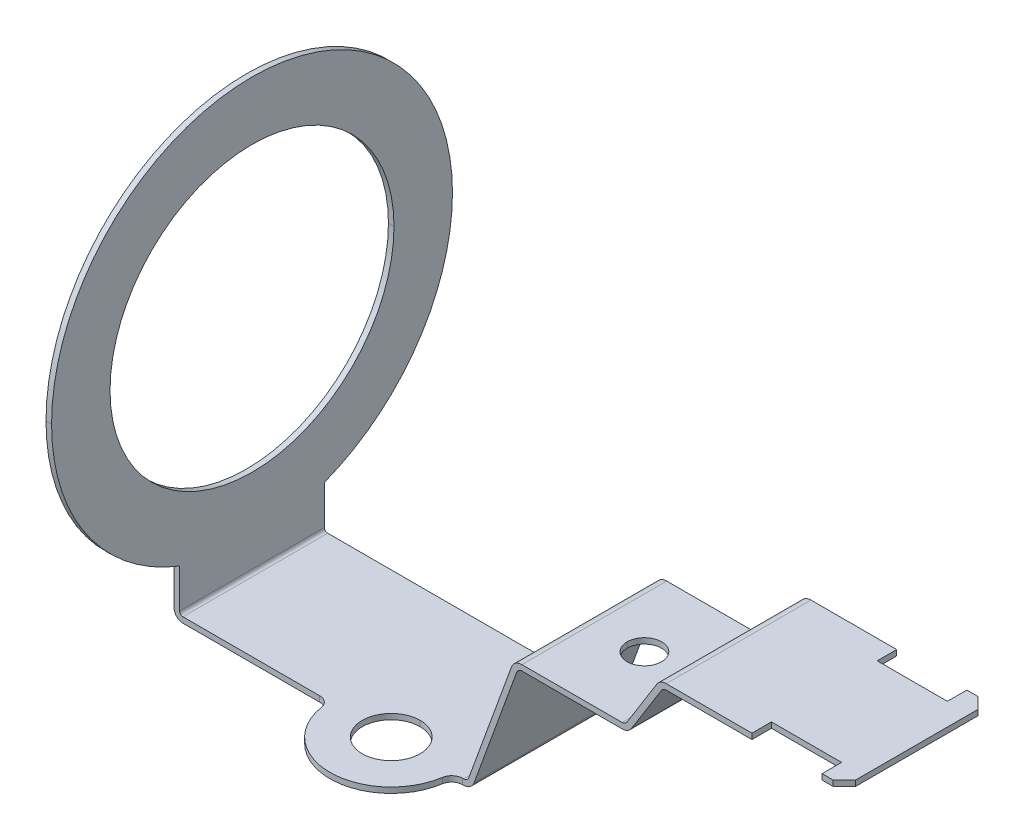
ISO-10303-21;
HEADER;
FILE_DESCRIPTION(('STEP AP214'),'2;1');
FILE_NAME('part.step','',(''),(''),'','','');
FILE_SCHEMA(('AUTOMOTIVE_DESIGN { 1 0 10303 214 1 1 1 1 }'));
ENDSEC;
DATA;
#1=APPLICATION_CONTEXT('core data for automotive mechanical design processes');
#2=APPLICATION_PROTOCOL_DEFINITION('international standard','automotive_design',2000,#1);
#3=PRODUCT_CONTEXT('',#1,'mechanical');
#4=PRODUCT('Part','Part','',(#3));
#5=PRODUCT_RELATED_PRODUCT_CATEGORY('part','',(#4));
#6=PRODUCT_DEFINITION_FORMATION('','',#4);
#7=PRODUCT_DEFINITION_CONTEXT('part definition',#1,'design');
#8=PRODUCT_DEFINITION('design','',#6,#7);
#9=PRODUCT_DEFINITION_SHAPE('','',#8);
#10=(LENGTH_UNIT() NAMED_UNIT(*) SI_UNIT(.MILLI.,.METRE.));
#11=(NAMED_UNIT(*) PLANE_ANGLE_UNIT() SI_UNIT($,.RADIAN.));
#12=(NAMED_UNIT(*) SI_UNIT($,.STERADIAN.) SOLID_ANGLE_UNIT());
#13=UNCERTAINTY_MEASURE_WITH_UNIT(LENGTH_MEASURE(1.E-05),#10,'distance_accuracy_value','');
#14=(GEOMETRIC_REPRESENTATION_CONTEXT(3) GLOBAL_UNCERTAINTY_ASSIGNED_CONTEXT((#13)) GLOBAL_UNIT_ASSIGNED_CONTEXT((#10,
#11,#12)) REPRESENTATION_CONTEXT('',''));
#15=CARTESIAN_POINT('',(0.,0.,0.));
#16=DIRECTION('',(0.,0.,1.));
#17=DIRECTION('',(1.,0.,0.));
#18=AXIS2_PLACEMENT_3D('',#15,#16,#17);
#19=CARTESIAN_POINT('',(25.9226162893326,-36.6417595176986,7.5));
#20=DIRECTION('',(0.,1.,0.));
#21=DIRECTION('',(-1.,0.,0.));
#22=AXIS2_PLACEMENT_3D('',#19,#20,#21);
#23=CYLINDRICAL_SURFACE('',#22,1.);
#24=CARTESIAN_POINT('',(25.9226162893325,-21.0854103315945,7.5));
#25=DIRECTION('',(0.,1.,0.));
#26=DIRECTION('',(0.,0.,1.));
#27=AXIS2_PLACEMENT_3D('',#24,#25,#26);
#28=CIRCLE('',#27,1.);
#29=CARTESIAN_POINT('',(25.9226162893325,-21.0854103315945,6.5));
#30=VERTEX_POINT('',#29);
#31=CARTESIAN_POINT('',(24.9345214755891,-21.0854103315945,7.34615384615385));
#32=VERTEX_POINT('',#31);
#33=EDGE_CURVE('E823',#30,#32,#28,.T.);
#34=ORIENTED_EDGE('',*,*,#33,.F.);
#35=DIRECTION('',(0.,-1.,0.));
#36=VECTOR('',#35,1.);
#37=CARTESIAN_POINT('',(25.9226162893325,-21.0854103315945,6.5));
#38=LINE('',#37,#36);
#39=CARTESIAN_POINT('',(25.9226162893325,-20.5854103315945,6.5));
#40=VERTEX_POINT('',#39);
#41=EDGE_CURVE('E489',#40,#30,#38,.T.);
#42=ORIENTED_EDGE('',*,*,#41,.F.);
#43=CARTESIAN_POINT('',(25.9226162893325,-20.5854103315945,7.5));
#44=DIRECTION('',(0.,-1.,0.));
#45=DIRECTION('',(1.,0.,0.));
#46=AXIS2_PLACEMENT_3D('',#43,#44,#45);
#47=CIRCLE('',#46,1.);
#48=CARTESIAN_POINT('',(24.9345214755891,-20.5854103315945,7.34615384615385));
#49=VERTEX_POINT('',#48);
#50=EDGE_CURVE('E540',#49,#40,#47,.T.);
#51=ORIENTED_EDGE('',*,*,#50,.F.);
#52=DIRECTION('',(0.,1.,0.));
#53=VECTOR('',#52,1.);
#54=CARTESIAN_POINT('',(24.9345214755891,-36.6417595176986,7.34615384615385));
#55=LINE('',#54,#53);
#56=EDGE_CURVE('E846',#32,#49,#55,.T.);
#57=ORIENTED_EDGE('',*,*,#56,.F.);
#58=EDGE_LOOP('',(#34,#42,#51,#57));
#59=FACE_BOUND('',#58,.T.);
#60=ADVANCED_FACE('F15',(#59),#23,.F.);
#61=CARTESIAN_POINT('',(13.0773837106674,-36.6417595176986,7.5));
#62=DIRECTION('',(0.,1.,0.));
#63=DIRECTION('',(-1.,0.,0.));
#64=AXIS2_PLACEMENT_3D('',#61,#62,#63);
#65=CYLINDRICAL_SURFACE('',#64,1.);
#66=CARTESIAN_POINT('',(13.0773837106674,-20.5854103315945,7.5));
#67=DIRECTION('',(0.,-1.,0.));
#68=DIRECTION('',(1.,0.,0.));
#69=AXIS2_PLACEMENT_3D('',#66,#67,#68);
#70=CIRCLE('',#69,1.);
#71=CARTESIAN_POINT('',(13.0773837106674,-20.5854103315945,6.5));
#72=VERTEX_POINT('',#71);
#73=CARTESIAN_POINT('',(14.0654785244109,-20.5854103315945,7.34615384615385));
#74=VERTEX_POINT('',#73);
#75=EDGE_CURVE('E676',#72,#74,#70,.T.);
#76=ORIENTED_EDGE('',*,*,#75,.F.);
#77=DIRECTION('',(0.,1.,0.));
#78=VECTOR('',#77,1.);
#79=CARTESIAN_POINT('',(13.0773837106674,-20.5854103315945,6.5));
#80=LINE('',#79,#78);
#81=CARTESIAN_POINT('',(13.0773837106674,-21.0854103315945,6.5));
#82=VERTEX_POINT('',#81);
#83=EDGE_CURVE('E36',#82,#72,#80,.T.);
#84=ORIENTED_EDGE('',*,*,#83,.F.);
#85=CARTESIAN_POINT('',(13.0773837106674,-21.0854103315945,7.5));
#86=DIRECTION('',(0.,1.,0.));
#87=DIRECTION('',(0.,0.,1.));
#88=AXIS2_PLACEMENT_3D('',#85,#86,#87);
#89=CIRCLE('',#88,1.);
#90=CARTESIAN_POINT('',(14.0654785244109,-21.0854103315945,7.34615384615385));
#91=VERTEX_POINT('',#90);
#92=EDGE_CURVE('E470',#91,#82,#89,.T.);
#93=ORIENTED_EDGE('',*,*,#92,.F.);
#94=DIRECTION('',(0.,-1.,0.));
#95=VECTOR('',#94,1.);
#96=CARTESIAN_POINT('',(14.0654785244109,-36.6417595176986,7.34615384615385));
#97=LINE('',#96,#95);
#98=EDGE_CURVE('E843',#74,#91,#97,.T.);
#99=ORIENTED_EDGE('',*,*,#98,.F.);
#100=EDGE_LOOP('',(#76,#84,#93,#99));
#101=FACE_BOUND('',#100,.T.);
#102=ADVANCED_FACE('F1062',(#101),#65,.F.);
#103=CARTESIAN_POINT('',(59.1917793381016,-20.0854103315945,6.5));
#104=DIRECTION('',(0.70710678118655,0.,0.707106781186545));
#105=DIRECTION('',(0.,-1.,0.));
#106=AXIS2_PLACEMENT_3D('',#103,#104,#105);
#107=PLANE('',#106);
#108=DIRECTION('',(-0.707106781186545,0.,0.70710678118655));
#109=VECTOR('',#108,1.);
#110=CARTESIAN_POINT('',(59.1917793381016,-4.58541033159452,6.5));
#111=LINE('',#110,#109);
#112=CARTESIAN_POINT('',(60.1917793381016,-4.58541033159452,5.5));
#113=VERTEX_POINT('',#112);
#114=CARTESIAN_POINT('',(59.1917793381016,-4.58541033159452,6.5));
#115=VERTEX_POINT('',#114);
#116=EDGE_CURVE('E783',#113,#115,#111,.T.);
#117=ORIENTED_EDGE('',*,*,#116,.F.);
#118=DIRECTION('',(0.,-1.,0.));
#119=VECTOR('',#118,1.);
#120=CARTESIAN_POINT('',(60.1917793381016,-4.58541033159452,5.5));
#121=LINE('',#120,#119);
#122=CARTESIAN_POINT('',(60.1917793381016,-4.08541033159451,5.5));
#123=VERTEX_POINT('',#122);
#124=EDGE_CURVE('E459',#123,#113,#121,.T.);
#125=ORIENTED_EDGE('',*,*,#124,.F.);
#126=DIRECTION('',(0.707106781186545,0.,-0.70710678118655));
#127=VECTOR('',#126,1.);
#128=CARTESIAN_POINT('',(59.1917793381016,-4.08541033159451,6.5));
#129=LINE('',#128,#127);
#130=CARTESIAN_POINT('',(59.1917793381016,-4.08541033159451,6.5));
#131=VERTEX_POINT('',#130);
#132=EDGE_CURVE('E682',#131,#123,#129,.T.);
#133=ORIENTED_EDGE('',*,*,#132,.F.);
#134=DIRECTION('',(0.,1.,0.));
#135=VECTOR('',#134,1.);
#136=CARTESIAN_POINT('',(59.1917793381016,-4.08541033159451,6.5));
#137=LINE('',#136,#135);
#138=EDGE_CURVE('E712',#115,#131,#137,.T.);
#139=ORIENTED_EDGE('',*,*,#138,.F.);
#140=EDGE_LOOP('',(#117,#125,#133,#139));
#141=FACE_BOUND('',#140,.T.);
#142=ADVANCED_FACE('F17',(#141),#107,.T.);
#143=CARTESIAN_POINT('',(60.1917793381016,-4.58541033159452,-5.5));
#144=DIRECTION('',(-0.707106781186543,0.,0.707106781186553));
#145=DIRECTION('',(0.,1.,0.));
#146=AXIS2_PLACEMENT_3D('',#143,#144,#145);
#147=PLANE('',#146);
#148=DIRECTION('',(0.707106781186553,0.,0.707106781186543));
#149=VECTOR('',#148,1.);
#150=CARTESIAN_POINT('',(60.1917793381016,-4.58541033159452,-5.5));
#151=LINE('',#150,#149);
#152=CARTESIAN_POINT('',(59.1917793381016,-4.58541033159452,-6.5));
#153=VERTEX_POINT('',#152);
#154=CARTESIAN_POINT('',(60.1917793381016,-4.58541033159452,-5.5));
#155=VERTEX_POINT('',#154);
#156=EDGE_CURVE('E775',#153,#155,#151,.T.);
#157=ORIENTED_EDGE('',*,*,#156,.F.);
#158=DIRECTION('',(0.,-1.,0.));
#159=VECTOR('',#158,1.);
#160=CARTESIAN_POINT('',(59.1917793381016,-20.0854103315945,-6.5));
#161=LINE('',#160,#159);
#162=CARTESIAN_POINT('',(59.1917793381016,-4.08541033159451,-6.5));
#163=VERTEX_POINT('',#162);
#164=EDGE_CURVE('E837',#163,#153,#161,.T.);
#165=ORIENTED_EDGE('',*,*,#164,.F.);
#166=DIRECTION('',(-0.707106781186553,0.,-0.707106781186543));
#167=VECTOR('',#166,1.);
#168=CARTESIAN_POINT('',(60.1917793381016,-4.08541033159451,-5.5));
#169=LINE('',#168,#167);
#170=CARTESIAN_POINT('',(60.1917793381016,-4.08541033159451,-5.5));
#171=VERTEX_POINT('',#170);
#172=EDGE_CURVE('E462',#171,#163,#169,.T.);
#173=ORIENTED_EDGE('',*,*,#172,.F.);
#174=DIRECTION('',(0.,1.,0.));
#175=VECTOR('',#174,1.);
#176=CARTESIAN_POINT('',(60.1917793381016,-4.58541033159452,-5.5));
#177=LINE('',#176,#175);
#178=EDGE_CURVE('E796',#155,#171,#177,.T.);
#179=ORIENTED_EDGE('',*,*,#178,.F.);
#180=EDGE_LOOP('',(#157,#165,#173,#179));
#181=FACE_BOUND('',#180,.T.);
#182=ADVANCED_FACE('F933',(#181),#147,.F.);
#183=CARTESIAN_POINT('',(58.1917793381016,-14.0854103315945,6.5));
#184=DIRECTION('',(1.,0.,0.));
#185=DIRECTION('',(0.,0.,-1.));
#186=AXIS2_PLACEMENT_3D('',#183,#184,#185);
#187=PLANE('',#186);
#188=DIRECTION('',(0.,1.,0.));
#189=VECTOR('',#188,1.);
#190=CARTESIAN_POINT('',(58.1917793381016,-14.0854103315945,6.5));
#191=LINE('',#190,#189);
#192=CARTESIAN_POINT('',(58.1917793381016,-4.58541033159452,6.5));
#193=VERTEX_POINT('',#192);
#194=CARTESIAN_POINT('',(58.1917793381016,-4.08541033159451,6.5));
#195=VERTEX_POINT('',#194);
#196=EDGE_CURVE('E717',#193,#195,#191,.T.);
#197=ORIENTED_EDGE('',*,*,#196,.T.);
#198=DIRECTION('',(0.,0.,-1.));
#199=VECTOR('',#198,1.);
#200=CARTESIAN_POINT('',(58.1917793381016,-4.08541033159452,6.5));
#201=LINE('',#200,#199);
#202=CARTESIAN_POINT('',(58.1917793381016,-4.08541033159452,4.75));
#203=VERTEX_POINT('',#202);
#204=EDGE_CURVE('E686',#195,#203,#201,.T.);
#205=ORIENTED_EDGE('',*,*,#204,.T.);
#206=DIRECTION('',(0.,1.,0.));
#207=VECTOR('',#206,1.);
#208=CARTESIAN_POINT('',(58.1917793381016,-14.0854103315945,4.75));
#209=LINE('',#208,#207);
#210=CARTESIAN_POINT('',(58.1917793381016,-4.58541033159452,4.75));
#211=VERTEX_POINT('',#210);
#212=EDGE_CURVE('E10',#211,#203,#209,.T.);
#213=ORIENTED_EDGE('',*,*,#212,.F.);
#214=DIRECTION('',(0.,0.,-1.));
#215=VECTOR('',#214,1.);
#216=CARTESIAN_POINT('',(58.1917793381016,-4.58541033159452,6.5));
#217=LINE('',#216,#215);
#218=EDGE_CURVE('E598',#193,#211,#217,.T.);
#219=ORIENTED_EDGE('',*,*,#218,.F.);
#220=EDGE_LOOP('',(#197,#205,#213,#219));
#221=FACE_BOUND('',#220,.T.);
#222=ADVANCED_FACE('F937',(#221),#187,.F.);
#223=CARTESIAN_POINT('',(51.8917793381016,-14.0854103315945,4.75));
#224=DIRECTION('',(0.,0.,-1.));
#225=DIRECTION('',(-1.,0.,0.));
#226=AXIS2_PLACEMENT_3D('',#223,#224,#225);
#227=PLANE('',#226);
#228=ORIENTED_EDGE('',*,*,#212,.T.);
#229=DIRECTION('',(-1.,0.,0.));
#230=VECTOR('',#229,1.);
#231=CARTESIAN_POINT('',(51.8917793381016,-4.08541033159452,4.75));
#232=LINE('',#231,#230);
#233=CARTESIAN_POINT('',(51.8917793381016,-4.08541033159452,4.75));
#234=VERTEX_POINT('',#233);
#235=EDGE_CURVE('E754',#203,#234,#232,.T.);
#236=ORIENTED_EDGE('',*,*,#235,.T.);
#237=DIRECTION('',(0.,1.,0.));
#238=VECTOR('',#237,1.);
#239=CARTESIAN_POINT('',(51.8917793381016,-14.0854103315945,4.75));
#240=LINE('',#239,#238);
#241=CARTESIAN_POINT('',(51.8917793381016,-4.58541033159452,4.75));
#242=VERTEX_POINT('',#241);
#243=EDGE_CURVE('E25',#242,#234,#240,.T.);
#244=ORIENTED_EDGE('',*,*,#243,.F.);
#245=DIRECTION('',(-1.,0.,0.));
#246=VECTOR('',#245,1.);
#247=CARTESIAN_POINT('',(44.1917793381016,-4.58541033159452,4.75));
#248=LINE('',#247,#246);
#249=EDGE_CURVE('E593',#211,#242,#248,.T.);
#250=ORIENTED_EDGE('',*,*,#249,.F.);
#251=EDGE_LOOP('',(#228,#236,#244,#250));
#252=FACE_BOUND('',#251,.T.);
#253=ADVANCED_FACE('F1253',(#252),#227,.F.);
#254=CARTESIAN_POINT('',(51.8917793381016,-14.0854103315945,6.5));
#255=DIRECTION('',(-1.,0.,0.));
#256=DIRECTION('',(0.,1.,0.));
#257=AXIS2_PLACEMENT_3D('',#254,#255,#256);
#258=PLANE('',#257);
#259=ORIENTED_EDGE('',*,*,#243,.T.);
#260=DIRECTION('',(0.,0.,1.));
#261=VECTOR('',#260,1.);
#262=CARTESIAN_POINT('',(51.8917793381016,-4.08541033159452,6.5));
#263=LINE('',#262,#261);
#264=CARTESIAN_POINT('',(51.8917793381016,-4.08541033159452,6.5));
#265=VERTEX_POINT('',#264);
#266=EDGE_CURVE('E757',#234,#265,#263,.T.);
#267=ORIENTED_EDGE('',*,*,#266,.T.);
#268=DIRECTION('',(0.,1.,0.));
#269=VECTOR('',#268,1.);
#270=CARTESIAN_POINT('',(51.8917793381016,-14.0854103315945,6.5));
#271=LINE('',#270,#269);
#272=CARTESIAN_POINT('',(51.8917793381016,-4.58541033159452,6.5));
#273=VERTEX_POINT('',#272);
#274=EDGE_CURVE('E539',#273,#265,#271,.T.);
#275=ORIENTED_EDGE('',*,*,#274,.F.);
#276=DIRECTION('',(0.,0.,1.));
#277=VECTOR('',#276,1.);
#278=CARTESIAN_POINT('',(51.8917793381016,-4.58541033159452,6.5));
#279=LINE('',#278,#277);
#280=EDGE_CURVE('E597',#242,#273,#279,.T.);
#281=ORIENTED_EDGE('',*,*,#280,.F.);
#282=EDGE_LOOP('',(#259,#267,#275,#281));
#283=FACE_BOUND('',#282,.T.);
#284=ADVANCED_FACE('F1023',(#283),#258,.F.);
#285=CARTESIAN_POINT('',(58.1917793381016,-14.0854103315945,-6.5));
#286=DIRECTION('',(1.,0.,0.));
#287=DIRECTION('',(0.,0.,1.));
#288=AXIS2_PLACEMENT_3D('',#285,#286,#287);
#289=PLANE('',#288);
#290=DIRECTION('',(0.,1.,0.));
#291=VECTOR('',#290,1.);
#292=CARTESIAN_POINT('',(58.1917793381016,-14.0854103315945,-4.75));
#293=LINE('',#292,#291);
#294=CARTESIAN_POINT('',(58.1917793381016,-4.58541033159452,-4.75));
#295=VERTEX_POINT('',#294);
#296=CARTESIAN_POINT('',(58.1917793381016,-4.08541033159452,-4.75));
#297=VERTEX_POINT('',#296);
#298=EDGE_CURVE('E851',#295,#297,#293,.T.);
#299=ORIENTED_EDGE('',*,*,#298,.T.);
#300=DIRECTION('',(0.,0.,-1.));
#301=VECTOR('',#300,1.);
#302=CARTESIAN_POINT('',(58.1917793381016,-4.08541033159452,-6.5));
#303=LINE('',#302,#301);
#304=CARTESIAN_POINT('',(58.1917793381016,-4.08541033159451,-6.5));
#305=VERTEX_POINT('',#304);
#306=EDGE_CURVE('E431',#297,#305,#303,.T.);
#307=ORIENTED_EDGE('',*,*,#306,.T.);
#308=DIRECTION('',(0.,1.,0.));
#309=VECTOR('',#308,1.);
#310=CARTESIAN_POINT('',(58.1917793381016,-20.0854103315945,-6.5));
#311=LINE('',#310,#309);
#312=CARTESIAN_POINT('',(58.1917793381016,-4.58541033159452,-6.5));
#313=VERTEX_POINT('',#312);
#314=EDGE_CURVE('E840',#313,#305,#311,.T.);
#315=ORIENTED_EDGE('',*,*,#314,.F.);
#316=DIRECTION('',(0.,0.,-1.));
#317=VECTOR('',#316,1.);
#318=CARTESIAN_POINT('',(58.1917793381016,-4.58541033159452,6.5));
#319=LINE('',#318,#317);
#320=EDGE_CURVE('E792',#295,#313,#319,.T.);
#321=ORIENTED_EDGE('',*,*,#320,.F.);
#322=EDGE_LOOP('',(#299,#307,#315,#321));
#323=FACE_BOUND('',#322,.T.);
#324=ADVANCED_FACE('F1018',(#323),#289,.F.);
#325=CARTESIAN_POINT('',(51.8917793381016,-14.0854103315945,-6.5));
#326=DIRECTION('',(-1.,0.,0.));
#327=DIRECTION('',(0.,0.,1.));
#328=AXIS2_PLACEMENT_3D('',#325,#326,#327);
#329=PLANE('',#328);
#330=DIRECTION('',(0.,-1.,0.));
#331=VECTOR('',#330,1.);
#332=CARTESIAN_POINT('',(51.8917793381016,-20.0854103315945,-6.5));
#333=LINE('',#332,#331);
#334=CARTESIAN_POINT('',(51.8917793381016,-4.08541033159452,-6.5));
#335=VERTEX_POINT('',#334);
#336=CARTESIAN_POINT('',(51.8917793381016,-4.58541033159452,-6.5));
#337=VERTEX_POINT('',#336);
#338=EDGE_CURVE('E592',#335,#337,#333,.T.);
#339=ORIENTED_EDGE('',*,*,#338,.F.);
#340=DIRECTION('',(0.,0.,1.));
#341=VECTOR('',#340,1.);
#342=CARTESIAN_POINT('',(51.8917793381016,-4.08541033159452,-6.5));
#343=LINE('',#342,#341);
#344=CARTESIAN_POINT('',(51.8917793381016,-4.08541033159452,-4.75));
#345=VERTEX_POINT('',#344);
#346=EDGE_CURVE('E729',#335,#345,#343,.T.);
#347=ORIENTED_EDGE('',*,*,#346,.T.);
#348=DIRECTION('',(0.,1.,0.));
#349=VECTOR('',#348,1.);
#350=CARTESIAN_POINT('',(51.8917793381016,-14.0854103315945,-4.75));
#351=LINE('',#350,#349);
#352=CARTESIAN_POINT('',(51.8917793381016,-4.58541033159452,-4.75));
#353=VERTEX_POINT('',#352);
#354=EDGE_CURVE('E346',#353,#345,#351,.T.);
#355=ORIENTED_EDGE('',*,*,#354,.F.);
#356=DIRECTION('',(0.,0.,1.));
#357=VECTOR('',#356,1.);
#358=CARTESIAN_POINT('',(51.8917793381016,-4.58541033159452,6.5));
#359=LINE('',#358,#357);
#360=EDGE_CURVE('E605',#337,#353,#359,.T.);
#361=ORIENTED_EDGE('',*,*,#360,.F.);
#362=EDGE_LOOP('',(#339,#347,#355,#361));
#363=FACE_BOUND('',#362,.T.);
#364=ADVANCED_FACE('F1022',(#363),#329,.F.);
#365=CARTESIAN_POINT('',(51.8917793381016,-14.0854103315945,-4.75));
#366=DIRECTION('',(0.,0.,1.));
#367=DIRECTION('',(1.,0.,0.));
#368=AXIS2_PLACEMENT_3D('',#365,#366,#367);
#369=PLANE('',#368);
#370=ORIENTED_EDGE('',*,*,#354,.T.);
#371=DIRECTION('',(1.,0.,0.));
#372=VECTOR('',#371,1.);
#373=CARTESIAN_POINT('',(51.8917793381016,-4.08541033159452,-4.75));
#374=LINE('',#373,#372);
#375=EDGE_CURVE('E434',#345,#297,#374,.T.);
#376=ORIENTED_EDGE('',*,*,#375,.T.);
#377=ORIENTED_EDGE('',*,*,#298,.F.);
#378=DIRECTION('',(1.,0.,0.));
#379=VECTOR('',#378,1.);
#380=CARTESIAN_POINT('',(44.1917793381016,-4.58541033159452,-4.75));
#381=LINE('',#380,#379);
#382=EDGE_CURVE('E704',#353,#295,#381,.T.);
#383=ORIENTED_EDGE('',*,*,#382,.F.);
#384=EDGE_LOOP('',(#370,#376,#377,#383));
#385=FACE_BOUND('',#384,.T.);
#386=ADVANCED_FACE('F862',(#385),#369,.F.);
#387=CARTESIAN_POINT('',(35.7359690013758,-23.0854103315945,0.));
#388=DIRECTION('',(0.,1.,0.));
#389=DIRECTION('',(-1.,0.,0.));
#390=AXIS2_PLACEMENT_3D('',#387,#388,#389);
#391=CYLINDRICAL_SURFACE('',#390,1.55);
#392=DIRECTION('',(0.,1.,0.));
#393=VECTOR('',#392,1.);
#394=CARTESIAN_POINT('',(37.2859690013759,-23.0854103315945,0.));
#395=LINE('',#394,#393);
#396=CARTESIAN_POINT('',(37.2859690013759,-9.58541033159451,0.));
#397=VERTEX_POINT('',#396);
#398=CARTESIAN_POINT('',(37.2859690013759,-9.08541033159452,0.));
#399=VERTEX_POINT('',#398);
#400=EDGE_CURVE('E1292',#397,#399,#395,.T.);
#401=ORIENTED_EDGE('',*,*,#400,.F.);
#402=CARTESIAN_POINT('',(35.7359690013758,-9.58541033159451,0.));
#403=DIRECTION('',(0.,1.,0.));
#404=DIRECTION('',(-1.,0.,0.));
#405=AXIS2_PLACEMENT_3D('',#402,#403,#404);
#406=CIRCLE('',#405,1.55);
#407=CARTESIAN_POINT('',(34.1859690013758,-9.58541033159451,0.));
#408=VERTEX_POINT('',#407);
#409=EDGE_CURVE('E762',#408,#397,#406,.T.);
#410=ORIENTED_EDGE('',*,*,#409,.F.);
#411=DIRECTION('',(0.,1.,0.));
#412=VECTOR('',#411,1.);
#413=CARTESIAN_POINT('',(34.1859690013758,-23.0854103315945,0.));
#414=LINE('',#413,#412);
#415=CARTESIAN_POINT('',(34.1859690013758,-9.08541033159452,0.));
#416=VERTEX_POINT('',#415);
#417=EDGE_CURVE('E1295',#408,#416,#414,.T.);
#418=ORIENTED_EDGE('',*,*,#417,.T.);
#419=CARTESIAN_POINT('',(35.7359690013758,-9.08541033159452,0.));
#420=DIRECTION('',(0.,1.,0.));
#421=DIRECTION('',(-1.,0.,0.));
#422=AXIS2_PLACEMENT_3D('',#419,#420,#421);
#423=CIRCLE('',#422,1.55);
#424=EDGE_CURVE('E511',#416,#399,#423,.T.);
#425=ORIENTED_EDGE('',*,*,#424,.T.);
#426=EDGE_LOOP('',(#401,#410,#418,#425));
#427=FACE_BOUND('',#426,.T.);
#428=ADVANCED_FACE('F857',(#427),#391,.F.);
#429=CARTESIAN_POINT('',(19.5,-20.5854103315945,6.5));
#430=DIRECTION('',(0.,1.,0.));
#431=DIRECTION('',(0.,0.,1.));
#432=AXIS2_PLACEMENT_3D('',#429,#430,#431);
#433=CYLINDRICAL_SURFACE('',#432,2.6);
#434=DIRECTION('',(0.,1.,0.));
#435=VECTOR('',#434,1.);
#436=CARTESIAN_POINT('',(19.5,-20.5854103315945,3.9));
#437=LINE('',#436,#435);
#438=CARTESIAN_POINT('',(19.5,-21.0854103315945,3.9));
#439=VERTEX_POINT('',#438);
#440=CARTESIAN_POINT('',(19.5,-20.5854103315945,3.9));
#441=VERTEX_POINT('',#440);
#442=EDGE_CURVE('E429',#439,#441,#437,.T.);
#443=ORIENTED_EDGE('',*,*,#442,.F.);
#444=CARTESIAN_POINT('',(19.5,-21.0854103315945,6.5));
#445=DIRECTION('',(0.,1.,0.));
#446=DIRECTION('',(0.,0.,1.));
#447=AXIS2_PLACEMENT_3D('',#444,#445,#446);
#448=CIRCLE('',#447,2.6);
#449=CARTESIAN_POINT('',(19.5,-21.0854103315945,9.1));
#450=VERTEX_POINT('',#449);
#451=EDGE_CURVE('E832',#450,#439,#448,.T.);
#452=ORIENTED_EDGE('',*,*,#451,.F.);
#453=DIRECTION('',(0.,1.,0.));
#454=VECTOR('',#453,1.);
#455=CARTESIAN_POINT('',(19.5,-20.5854103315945,9.1));
#456=LINE('',#455,#454);
#457=CARTESIAN_POINT('',(19.5,-20.5854103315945,9.1));
#458=VERTEX_POINT('',#457);
#459=EDGE_CURVE('E442',#450,#458,#456,.T.);
#460=ORIENTED_EDGE('',*,*,#459,.T.);
#461=CARTESIAN_POINT('',(19.5,-20.5854103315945,6.5));
#462=DIRECTION('',(0.,1.,0.));
#463=DIRECTION('',(0.,0.,1.));
#464=AXIS2_PLACEMENT_3D('',#461,#462,#463);
#465=CIRCLE('',#464,2.6);
#466=EDGE_CURVE('E561',#458,#441,#465,.T.);
#467=ORIENTED_EDGE('',*,*,#466,.T.);
#468=EDGE_LOOP('',(#443,#452,#460,#467));
#469=FACE_BOUND('',#468,.T.);
#470=ADVANCED_FACE('F861',(#469),#433,.F.);
#471=CARTESIAN_POINT('',(19.5,-36.6417595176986,6.5));
#472=DIRECTION('',(0.,1.,0.));
#473=DIRECTION('',(-1.,0.,0.));
#474=AXIS2_PLACEMENT_3D('',#471,#472,#473);
#475=CYLINDRICAL_SURFACE('',#474,5.5);
#476=CARTESIAN_POINT('',(19.5,-20.5854103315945,6.5));
#477=DIRECTION('',(0.,1.,0.));
#478=DIRECTION('',(-1.,0.,0.));
#479=AXIS2_PLACEMENT_3D('',#476,#477,#478);
#480=CIRCLE('',#479,5.5);
#481=EDGE_CURVE('E544',#74,#49,#480,.T.);
#482=ORIENTED_EDGE('',*,*,#481,.F.);
#483=ORIENTED_EDGE('',*,*,#98,.T.);
#484=CARTESIAN_POINT('',(19.5,-21.0854103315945,6.5));
#485=DIRECTION('',(0.,-1.,0.));
#486=DIRECTION('',(0.,0.,1.));
#487=AXIS2_PLACEMENT_3D('',#484,#485,#486);
#488=CIRCLE('',#487,5.5);
#489=EDGE_CURVE('E475',#32,#91,#488,.T.);
#490=ORIENTED_EDGE('',*,*,#489,.F.);
#491=ORIENTED_EDGE('',*,*,#56,.T.);
#492=EDGE_LOOP('',(#482,#483,#490,#491));
#493=FACE_BOUND('',#492,.T.);
#494=ADVANCED_FACE('F1217',(#493),#475,.T.);
#495=CARTESIAN_POINT('',(26.,-20.0854103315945,-6.5));
#496=DIRECTION('',(0.,0.,1.));
#497=DIRECTION('',(1.,0.,0.));
#498=AXIS2_PLACEMENT_3D('',#495,#496,#497);
#499=PLANE('',#498);
#500=DIRECTION('',(-1.,0.,0.));
#501=VECTOR('',#500,1.);
#502=CARTESIAN_POINT('',(60.1917793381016,-4.08541033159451,-6.5));
#503=LINE('',#502,#501);
#504=EDGE_CURVE('E435',#163,#305,#503,.T.);
#505=ORIENTED_EDGE('',*,*,#504,.F.);
#506=ORIENTED_EDGE('',*,*,#164,.T.);
#507=DIRECTION('',(1.,0.,0.));
#508=VECTOR('',#507,1.);
#509=CARTESIAN_POINT('',(44.1917793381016,-4.58541033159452,-6.5));
#510=LINE('',#509,#508);
#511=EDGE_CURVE('E663',#313,#153,#510,.T.);
#512=ORIENTED_EDGE('',*,*,#511,.F.);
#513=ORIENTED_EDGE('',*,*,#314,.T.);
#514=EDGE_LOOP('',(#505,#506,#512,#513));
#515=FACE_BOUND('',#514,.T.);
#516=ADVANCED_FACE('F1208',(#515),#499,.F.);
#517=CARTESIAN_POINT('',(26.,-20.0854103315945,6.5));
#518=DIRECTION('',(0.,0.,1.));
#519=DIRECTION('',(1.,0.,0.));
#520=AXIS2_PLACEMENT_3D('',#517,#518,#519);
#521=PLANE('',#520);
#522=DIRECTION('',(1.,0.,0.));
#523=VECTOR('',#522,1.);
#524=CARTESIAN_POINT('',(0.8,-21.0854103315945,6.5));
#525=LINE('',#524,#523);
#526=CARTESIAN_POINT('',(0.8,-21.0854103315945,6.5));
#527=VERTEX_POINT('',#526);
#528=EDGE_CURVE('E474',#527,#82,#525,.T.);
#529=ORIENTED_EDGE('',*,*,#528,.T.);
#530=ORIENTED_EDGE('',*,*,#83,.T.);
#531=DIRECTION('',(-1.,0.,0.));
#532=VECTOR('',#531,1.);
#533=CARTESIAN_POINT('',(26.,-20.5854103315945,6.5));
#534=LINE('',#533,#532);
#535=CARTESIAN_POINT('',(0.8,-20.5854103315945,6.5));
#536=VERTEX_POINT('',#535);
#537=EDGE_CURVE('E672',#72,#536,#534,.T.);
#538=ORIENTED_EDGE('',*,*,#537,.T.);
#539=CARTESIAN_POINT('',(0.8,-20.2854103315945,6.5));
#540=DIRECTION('',(0.,0.,-1.));
#541=DIRECTION('',(-1.,0.,0.));
#542=AXIS2_PLACEMENT_3D('',#539,#540,#541);
#543=CIRCLE('',#542,0.299999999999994);
#544=CARTESIAN_POINT('',(0.5,-20.2854103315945,6.5));
#545=VERTEX_POINT('',#544);
#546=EDGE_CURVE('E557',#536,#545,#543,.T.);
#547=ORIENTED_EDGE('',*,*,#546,.T.);
#548=DIRECTION('',(0.,1.,0.));
#549=VECTOR('',#548,1.);
#550=CARTESIAN_POINT('',(0.5,-20.2854103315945,6.5));
#551=LINE('',#550,#549);
#552=CARTESIAN_POINT('',(0.5,-16.7854103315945,6.5));
#553=VERTEX_POINT('',#552);
#554=EDGE_CURVE('E588',#545,#553,#551,.T.);
#555=ORIENTED_EDGE('',*,*,#554,.T.);
#556=DIRECTION('',(-1.,0.,0.));
#557=VECTOR('',#556,1.);
#558=CARTESIAN_POINT('',(0.5,-16.7854103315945,6.5));
#559=LINE('',#558,#557);
#560=CARTESIAN_POINT('',(0.,-16.7854103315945,6.5));
#561=VERTEX_POINT('',#560);
#562=EDGE_CURVE('E469',#553,#561,#559,.T.);
#563=ORIENTED_EDGE('',*,*,#562,.T.);
#564=DIRECTION('',(0.,-1.,0.));
#565=VECTOR('',#564,1.);
#566=CARTESIAN_POINT('',(0.,-16.7854103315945,6.5));
#567=LINE('',#566,#565);
#568=CARTESIAN_POINT('',(0.,-20.2854103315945,6.5));
#569=VERTEX_POINT('',#568);
#570=EDGE_CURVE('E735',#561,#569,#567,.T.);
#571=ORIENTED_EDGE('',*,*,#570,.T.);
#572=CARTESIAN_POINT('',(0.8,-20.2854103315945,6.5));
#573=DIRECTION('',(0.,0.,1.));
#574=DIRECTION('',(1.,0.,0.));
#575=AXIS2_PLACEMENT_3D('',#572,#573,#574);
#576=CIRCLE('',#575,0.8);
#577=EDGE_CURVE('E819',#569,#527,#576,.T.);
#578=ORIENTED_EDGE('',*,*,#577,.T.);
#579=EDGE_LOOP('',(#529,#530,#538,#547,#555,#563,#571,#578));
#580=FACE_BOUND('',#579,.T.);
#581=ADVANCED_FACE('F1199',(#580),#521,.T.);
#582=CARTESIAN_POINT('',(0.8,-21.0854103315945,6.5));
#583=DIRECTION('',(0.,1.,0.));
#584=DIRECTION('',(1.,0.,0.));
#585=AXIS2_PLACEMENT_3D('',#582,#583,#584);
#586=PLANE('',#585);
#587=ORIENTED_EDGE('',*,*,#451,.T.);
#588=CARTESIAN_POINT('',(19.5,-21.0854103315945,6.5));
#589=DIRECTION('',(0.,1.,0.));
#590=DIRECTION('',(0.,0.,1.));
#591=AXIS2_PLACEMENT_3D('',#588,#589,#590);
#592=CIRCLE('',#591,2.6);
#593=EDGE_CURVE('E1327',#439,#450,#592,.T.);
#594=ORIENTED_EDGE('',*,*,#593,.T.);
#595=EDGE_LOOP('',(#587,#594));
#596=FACE_BOUND('',#595,.T.);
#597=DIRECTION('',(1.,0.,0.));
#598=VECTOR('',#597,1.);
#599=CARTESIAN_POINT('',(0.8,-21.0854103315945,6.5));
#600=LINE('',#599,#598);
#601=CARTESIAN_POINT('',(26.,-21.0854103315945,6.5));
#602=VERTEX_POINT('',#601);
#603=EDGE_CURVE('E498',#30,#602,#600,.T.);
#604=ORIENTED_EDGE('',*,*,#603,.F.);
#605=ORIENTED_EDGE('',*,*,#33,.T.);
#606=ORIENTED_EDGE('',*,*,#489,.T.);
#607=ORIENTED_EDGE('',*,*,#92,.T.);
#608=ORIENTED_EDGE('',*,*,#528,.F.);
#609=DIRECTION('',(0.,0.,-1.));
#610=VECTOR('',#609,1.);
#611=CARTESIAN_POINT('',(0.8,-21.0854103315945,6.5));
#612=LINE('',#611,#610);
#613=CARTESIAN_POINT('',(0.8,-21.0854103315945,-6.5));
#614=VERTEX_POINT('',#613);
#615=EDGE_CURVE('E560',#527,#614,#612,.T.);
#616=ORIENTED_EDGE('',*,*,#615,.T.);
#617=DIRECTION('',(1.,0.,0.));
#618=VECTOR('',#617,1.);
#619=CARTESIAN_POINT('',(0.8,-21.0854103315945,-6.5));
#620=LINE('',#619,#618);
#621=CARTESIAN_POINT('',(26.,-21.0854103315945,-6.5));
#622=VERTEX_POINT('',#621);
#623=EDGE_CURVE('E640',#614,#622,#620,.T.);
#624=ORIENTED_EDGE('',*,*,#623,.T.);
#625=DIRECTION('',(0.,0.,-1.));
#626=VECTOR('',#625,1.);
#627=CARTESIAN_POINT('',(26.,-21.0854103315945,6.5));
#628=LINE('',#627,#626);
#629=EDGE_CURVE('E748',#602,#622,#628,.T.);
#630=ORIENTED_EDGE('',*,*,#629,.F.);
#631=EDGE_LOOP('',(#604,#605,#606,#607,#608,#616,#624,#630));
#632=FACE_BOUND('',#631,.T.);
#633=ADVANCED_FACE('F1190',(#596,#632),#586,.F.);
#634=CARTESIAN_POINT('',(0.8,-20.2854103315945,6.5));
#635=DIRECTION('',(0.,0.,-1.));
#636=DIRECTION('',(-1.,0.,0.));
#637=AXIS2_PLACEMENT_3D('',#634,#635,#636);
#638=CYLINDRICAL_SURFACE('',#637,0.8);
#639=CARTESIAN_POINT('',(0.8,-20.2854103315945,-6.5));
#640=DIRECTION('',(0.,0.,1.));
#641=DIRECTION('',(1.,0.,0.));
#642=AXIS2_PLACEMENT_3D('',#639,#640,#641);
#643=CIRCLE('',#642,0.8);
#644=CARTESIAN_POINT('',(0.,-20.2854103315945,-6.5));
#645=VERTEX_POINT('',#644);
#646=EDGE_CURVE('E644',#645,#614,#643,.T.);
#647=ORIENTED_EDGE('',*,*,#646,.T.);
#648=ORIENTED_EDGE('',*,*,#615,.F.);
#649=ORIENTED_EDGE('',*,*,#577,.F.);
#650=DIRECTION('',(0.,0.,-1.));
#651=VECTOR('',#650,1.);
#652=CARTESIAN_POINT('',(0.,-20.2854103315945,6.5));
#653=LINE('',#652,#651);
#654=EDGE_CURVE('E403',#569,#645,#653,.T.);
#655=ORIENTED_EDGE('',*,*,#654,.T.);
#656=EDGE_LOOP('',(#647,#648,#649,#655));
#657=FACE_BOUND('',#656,.T.);
#658=ADVANCED_FACE('F1181',(#657),#638,.T.);
#659=CARTESIAN_POINT('',(0.8,-20.2854103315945,6.5));
#660=DIRECTION('',(0.,0.,-1.));
#661=DIRECTION('',(-1.,0.,0.));
#662=AXIS2_PLACEMENT_3D('',#659,#660,#661);
#663=CYLINDRICAL_SURFACE('',#662,0.299999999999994);
#664=CARTESIAN_POINT('',(0.8,-20.2854103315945,-6.5));
#665=DIRECTION('',(0.,0.,-1.));
#666=DIRECTION('',(-1.,0.,0.));
#667=AXIS2_PLACEMENT_3D('',#664,#665,#666);
#668=CIRCLE('',#667,0.299999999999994);
#669=CARTESIAN_POINT('',(0.8,-20.5854103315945,-6.5));
#670=VERTEX_POINT('',#669);
#671=CARTESIAN_POINT('',(0.5,-20.2854103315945,-6.5));
#672=VERTEX_POINT('',#671);
#673=EDGE_CURVE('E660',#670,#672,#668,.T.);
#674=ORIENTED_EDGE('',*,*,#673,.T.);
#675=DIRECTION('',(0.,0.,-1.));
#676=VECTOR('',#675,1.);
#677=CARTESIAN_POINT('',(0.5,-20.2854103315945,6.5));
#678=LINE('',#677,#676);
#679=EDGE_CURVE('E438',#545,#672,#678,.T.);
#680=ORIENTED_EDGE('',*,*,#679,.F.);
#681=ORIENTED_EDGE('',*,*,#546,.F.);
#682=DIRECTION('',(0.,0.,-1.));
#683=VECTOR('',#682,1.);
#684=CARTESIAN_POINT('',(0.8,-20.5854103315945,6.5));
#685=LINE('',#684,#683);
#686=EDGE_CURVE('E543',#536,#670,#685,.T.);
#687=ORIENTED_EDGE('',*,*,#686,.T.);
#688=EDGE_LOOP('',(#674,#680,#681,#687));
#689=FACE_BOUND('',#688,.T.);
#690=ADVANCED_FACE('F1172',(#689),#663,.F.);
#691=CARTESIAN_POINT('',(26.,-20.5854103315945,6.5));
#692=DIRECTION('',(0.,-1.,0.));
#693=DIRECTION('',(0.,0.,-1.));
#694=AXIS2_PLACEMENT_3D('',#691,#692,#693);
#695=PLANE('',#694);
#696=ORIENTED_EDGE('',*,*,#466,.F.);
#697=CARTESIAN_POINT('',(19.5,-20.5854103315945,6.5));
#698=DIRECTION('',(0.,1.,0.));
#699=DIRECTION('',(0.,0.,1.));
#700=AXIS2_PLACEMENT_3D('',#697,#698,#699);
#701=CIRCLE('',#700,2.6);
#702=EDGE_CURVE('E439',#441,#458,#701,.T.);
#703=ORIENTED_EDGE('',*,*,#702,.F.);
#704=EDGE_LOOP('',(#696,#703));
#705=FACE_BOUND('',#704,.T.);
#706=ORIENTED_EDGE('',*,*,#537,.F.);
#707=ORIENTED_EDGE('',*,*,#75,.T.);
#708=ORIENTED_EDGE('',*,*,#481,.T.);
#709=ORIENTED_EDGE('',*,*,#50,.T.);
#710=DIRECTION('',(-1.,0.,0.));
#711=VECTOR('',#710,1.);
#712=CARTESIAN_POINT('',(26.,-20.5854103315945,6.5));
#713=LINE('',#712,#711);
#714=CARTESIAN_POINT('',(26.,-20.5854103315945,6.5));
#715=VERTEX_POINT('',#714);
#716=EDGE_CURVE('E479',#715,#40,#713,.T.);
#717=ORIENTED_EDGE('',*,*,#716,.F.);
#718=DIRECTION('',(0.,0.,-1.));
#719=VECTOR('',#718,1.);
#720=CARTESIAN_POINT('',(26.,-20.5854103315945,6.5));
#721=LINE('',#720,#719);
#722=CARTESIAN_POINT('',(26.,-20.5854103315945,-6.5));
#723=VERTEX_POINT('',#722);
#724=EDGE_CURVE('E677',#715,#723,#721,.T.);
#725=ORIENTED_EDGE('',*,*,#724,.T.);
#726=DIRECTION('',(-1.,0.,0.));
#727=VECTOR('',#726,1.);
#728=CARTESIAN_POINT('',(26.,-20.5854103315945,-6.5));
#729=LINE('',#728,#727);
#730=EDGE_CURVE('E667',#723,#670,#729,.T.);
#731=ORIENTED_EDGE('',*,*,#730,.T.);
#732=ORIENTED_EDGE('',*,*,#686,.F.);
#733=EDGE_LOOP('',(#706,#707,#708,#709,#717,#725,#731,#732));
#734=FACE_BOUND('',#733,.T.);
#735=ADVANCED_FACE('F1163',(#705,#734),#695,.F.);
#736=CARTESIAN_POINT('',(26.,-20.0854103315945,6.5));
#737=DIRECTION('',(0.,0.,-1.));
#738=DIRECTION('',(-1.,0.,0.));
#739=AXIS2_PLACEMENT_3D('',#736,#737,#738);
#740=CYLINDRICAL_SURFACE('',#739,0.5);
#741=CARTESIAN_POINT('',(26.,-20.0854103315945,-6.5));
#742=DIRECTION('',(0.,0.,-1.));
#743=DIRECTION('',(-1.,0.,0.));
#744=AXIS2_PLACEMENT_3D('',#741,#742,#743);
#745=CIRCLE('',#744,0.5);
#746=CARTESIAN_POINT('',(26.4698463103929,-20.2564204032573,-6.5));
#747=VERTEX_POINT('',#746);
#748=EDGE_CURVE('E671',#747,#723,#745,.T.);
#749=ORIENTED_EDGE('',*,*,#748,.T.);
#750=ORIENTED_EDGE('',*,*,#724,.F.);
#751=CARTESIAN_POINT('',(26.,-20.0854103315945,6.5));
#752=DIRECTION('',(0.,0.,-1.));
#753=DIRECTION('',(-1.,0.,0.));
#754=AXIS2_PLACEMENT_3D('',#751,#752,#753);
#755=CIRCLE('',#754,0.5);
#756=CARTESIAN_POINT('',(26.4698463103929,-20.2564204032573,6.5));
#757=VERTEX_POINT('',#756);
#758=EDGE_CURVE('E578',#757,#715,#755,.T.);
#759=ORIENTED_EDGE('',*,*,#758,.F.);
#760=DIRECTION('',(0.,0.,-1.));
#761=VECTOR('',#760,1.);
#762=CARTESIAN_POINT('',(26.4698463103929,-20.2564204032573,6.5));
#763=LINE('',#762,#761);
#764=EDGE_CURVE('E510',#757,#747,#763,.T.);
#765=ORIENTED_EDGE('',*,*,#764,.T.);
#766=EDGE_LOOP('',(#749,#750,#759,#765));
#767=FACE_BOUND('',#766,.T.);
#768=ADVANCED_FACE('F1154',(#767),#740,.F.);
#769=CARTESIAN_POINT('',(30.29627638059,-9.74339018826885,6.5));
#770=DIRECTION('',(0.93969262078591,-0.342020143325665,0.));
#771=DIRECTION('',(0.,0.,-1.));
#772=AXIS2_PLACEMENT_3D('',#769,#770,#771);
#773=PLANE('',#772);
#774=DIRECTION('',(-0.342020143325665,-0.93969262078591,0.));
#775=VECTOR('',#774,1.);
#776=CARTESIAN_POINT('',(30.29627638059,-9.74339018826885,-6.5));
#777=LINE('',#776,#775);
#778=CARTESIAN_POINT('',(30.29627638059,-9.74339018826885,-6.5));
#779=VERTEX_POINT('',#778);
#780=EDGE_CURVE('E681',#779,#747,#777,.T.);
#781=ORIENTED_EDGE('',*,*,#780,.T.);
#782=ORIENTED_EDGE('',*,*,#764,.F.);
#783=DIRECTION('',(-0.342020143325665,-0.93969262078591,0.));
#784=VECTOR('',#783,1.);
#785=CARTESIAN_POINT('',(30.29627638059,-9.74339018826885,6.5));
#786=LINE('',#785,#784);
#787=CARTESIAN_POINT('',(30.29627638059,-9.74339018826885,6.5));
#788=VERTEX_POINT('',#787);
#789=EDGE_CURVE('E574',#788,#757,#786,.T.);
#790=ORIENTED_EDGE('',*,*,#789,.F.);
#791=DIRECTION('',(0.,0.,-1.));
#792=VECTOR('',#791,1.);
#793=CARTESIAN_POINT('',(30.29627638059,-9.74339018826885,6.5));
#794=LINE('',#793,#792);
#795=EDGE_CURVE('E507',#788,#779,#794,.T.);
#796=ORIENTED_EDGE('',*,*,#795,.T.);
#797=EDGE_LOOP('',(#781,#782,#790,#796));
#798=FACE_BOUND('',#797,.T.);
#799=ADVANCED_FACE('F1145',(#798),#773,.F.);
#800=CARTESIAN_POINT('',(31.2359690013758,-10.0854103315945,6.5));
#801=DIRECTION('',(0.,0.,-1.));
#802=DIRECTION('',(-1.,0.,0.));
#803=AXIS2_PLACEMENT_3D('',#800,#801,#802);
#804=CYLINDRICAL_SURFACE('',#803,1.);
#805=CARTESIAN_POINT('',(31.2359690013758,-10.0854103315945,-6.5));
#806=DIRECTION('',(0.,0.,1.));
#807=DIRECTION('',(1.,0.,0.));
#808=AXIS2_PLACEMENT_3D('',#805,#806,#807);
#809=CIRCLE('',#808,1.);
#810=CARTESIAN_POINT('',(31.2359690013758,-9.08541033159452,-6.5));
#811=VERTEX_POINT('',#810);
#812=EDGE_CURVE('E690',#811,#779,#809,.T.);
#813=ORIENTED_EDGE('',*,*,#812,.T.);
#814=ORIENTED_EDGE('',*,*,#795,.F.);
#815=CARTESIAN_POINT('',(31.2359690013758,-10.0854103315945,6.5));
#816=DIRECTION('',(0.,0.,1.));
#817=DIRECTION('',(1.,0.,0.));
#818=AXIS2_PLACEMENT_3D('',#815,#816,#817);
#819=CIRCLE('',#818,1.);
#820=CARTESIAN_POINT('',(31.2359690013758,-9.08541033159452,6.5));
#821=VERTEX_POINT('',#820);
#822=EDGE_CURVE('E570',#821,#788,#819,.T.);
#823=ORIENTED_EDGE('',*,*,#822,.F.);
#824=DIRECTION('',(0.,0.,-1.));
#825=VECTOR('',#824,1.);
#826=CARTESIAN_POINT('',(31.2359690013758,-9.08541033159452,6.5));
#827=LINE('',#826,#825);
#828=EDGE_CURVE('E627',#821,#811,#827,.T.);
#829=ORIENTED_EDGE('',*,*,#828,.T.);
#830=EDGE_LOOP('',(#813,#814,#823,#829));
#831=FACE_BOUND('',#830,.T.);
#832=ADVANCED_FACE('F1130',(#831),#804,.T.);
#833=CARTESIAN_POINT('',(40.2359690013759,-9.08541033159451,6.5));
#834=DIRECTION('',(0.,-1.,0.));
#835=DIRECTION('',(0.,0.,-1.));
#836=AXIS2_PLACEMENT_3D('',#833,#834,#835);
#837=PLANE('',#836);
#838=ORIENTED_EDGE('',*,*,#424,.F.);
#839=CARTESIAN_POINT('',(35.7359690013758,-9.08541033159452,0.));
#840=DIRECTION('',(0.,1.,0.));
#841=DIRECTION('',(-1.,0.,0.));
#842=AXIS2_PLACEMENT_3D('',#839,#840,#841);
#843=CIRCLE('',#842,1.55);
#844=EDGE_CURVE('E1297',#399,#416,#843,.T.);
#845=ORIENTED_EDGE('',*,*,#844,.F.);
#846=EDGE_LOOP('',(#838,#845));
#847=FACE_BOUND('',#846,.T.);
#848=DIRECTION('',(-1.,0.,0.));
#849=VECTOR('',#848,1.);
#850=CARTESIAN_POINT('',(40.2359690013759,-9.08541033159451,-6.5));
#851=LINE('',#850,#849);
#852=CARTESIAN_POINT('',(40.2359690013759,-9.08541033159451,-6.5));
#853=VERTEX_POINT('',#852);
#854=EDGE_CURVE('E694',#853,#811,#851,.T.);
#855=ORIENTED_EDGE('',*,*,#854,.T.);
#856=ORIENTED_EDGE('',*,*,#828,.F.);
#857=DIRECTION('',(-1.,0.,0.));
#858=VECTOR('',#857,1.);
#859=CARTESIAN_POINT('',(40.2359690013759,-9.08541033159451,6.5));
#860=LINE('',#859,#858);
#861=CARTESIAN_POINT('',(40.2359690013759,-9.08541033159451,6.5));
#862=VERTEX_POINT('',#861);
#863=EDGE_CURVE('E566',#862,#821,#860,.T.);
#864=ORIENTED_EDGE('',*,*,#863,.F.);
#865=DIRECTION('',(0.,0.,-1.));
#866=VECTOR('',#865,1.);
#867=CARTESIAN_POINT('',(40.2359690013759,-9.08541033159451,6.5));
#868=LINE('',#867,#866);
#869=EDGE_CURVE('E647',#862,#853,#868,.T.);
#870=ORIENTED_EDGE('',*,*,#869,.T.);
#871=EDGE_LOOP('',(#855,#856,#864,#870));
#872=FACE_BOUND('',#871,.T.);
#873=ADVANCED_FACE('F1121',(#847,#872),#837,.F.);
#874=CARTESIAN_POINT('',(40.2359690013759,-8.58541033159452,6.5));
#875=DIRECTION('',(0.,0.,-1.));
#876=DIRECTION('',(-1.,0.,0.));
#877=AXIS2_PLACEMENT_3D('',#874,#875,#876);
#878=CYLINDRICAL_SURFACE('',#877,0.5);
#879=CARTESIAN_POINT('',(40.2359690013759,-8.58541033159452,-6.5));
#880=DIRECTION('',(0.,0.,-1.));
#881=DIRECTION('',(-1.,0.,0.));
#882=AXIS2_PLACEMENT_3D('',#879,#880,#881);
#883=CIRCLE('',#882,0.5);
#884=CARTESIAN_POINT('',(40.6599930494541,-8.85036996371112,-6.5));
#885=VERTEX_POINT('',#884);
#886=EDGE_CURVE('E700',#885,#853,#883,.T.);
#887=ORIENTED_EDGE('',*,*,#886,.T.);
#888=ORIENTED_EDGE('',*,*,#869,.F.);
#889=CARTESIAN_POINT('',(40.2359690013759,-8.58541033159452,6.5));
#890=DIRECTION('',(0.,0.,-1.));
#891=DIRECTION('',(-1.,0.,0.));
#892=AXIS2_PLACEMENT_3D('',#889,#890,#891);
#893=CIRCLE('',#892,0.5);
#894=CARTESIAN_POINT('',(40.6599930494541,-8.85036996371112,6.5));
#895=VERTEX_POINT('',#894);
#896=EDGE_CURVE('E565',#895,#862,#893,.T.);
#897=ORIENTED_EDGE('',*,*,#896,.F.);
#898=DIRECTION('',(0.,0.,-1.));
#899=VECTOR('',#898,1.);
#900=CARTESIAN_POINT('',(40.6599930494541,-8.85036996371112,6.5));
#901=LINE('',#900,#899);
#902=EDGE_CURVE('E749',#895,#885,#901,.T.);
#903=ORIENTED_EDGE('',*,*,#902,.T.);
#904=EDGE_LOOP('',(#887,#888,#897,#903));
#905=FACE_BOUND('',#904,.T.);
#906=ADVANCED_FACE('F1112',(#905),#878,.F.);
#907=CARTESIAN_POINT('',(43.3437312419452,-4.55549106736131,6.5));
#908=DIRECTION('',(0.848048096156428,-0.529919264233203,0.));
#909=DIRECTION('',(0.,0.,-1.));
#910=AXIS2_PLACEMENT_3D('',#907,#908,#909);
#911=PLANE('',#910);
#912=DIRECTION('',(-0.529919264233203,-0.848048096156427,0.));
#913=VECTOR('',#912,1.);
#914=CARTESIAN_POINT('',(43.3437312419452,-4.55549106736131,-6.5));
#915=LINE('',#914,#913);
#916=CARTESIAN_POINT('',(43.3437312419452,-4.55549106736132,-6.5));
#917=VERTEX_POINT('',#916);
#918=EDGE_CURVE('E695',#917,#885,#915,.T.);
#919=ORIENTED_EDGE('',*,*,#918,.T.);
#920=ORIENTED_EDGE('',*,*,#902,.F.);
#921=DIRECTION('',(-0.529919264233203,-0.848048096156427,0.));
#922=VECTOR('',#921,1.);
#923=CARTESIAN_POINT('',(43.3437312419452,-4.55549106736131,6.5));
#924=LINE('',#923,#922);
#925=CARTESIAN_POINT('',(43.3437312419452,-4.55549106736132,6.5));
#926=VERTEX_POINT('',#925);
#927=EDGE_CURVE('E556',#926,#895,#924,.T.);
#928=ORIENTED_EDGE('',*,*,#927,.F.);
#929=DIRECTION('',(0.,0.,-1.));
#930=VECTOR('',#929,1.);
#931=CARTESIAN_POINT('',(43.3437312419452,-4.55549106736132,6.5));
#932=LINE('',#931,#930);
#933=EDGE_CURVE('E685',#926,#917,#932,.T.);
#934=ORIENTED_EDGE('',*,*,#933,.T.);
#935=EDGE_LOOP('',(#919,#920,#928,#934));
#936=FACE_BOUND('',#935,.T.);
#937=ADVANCED_FACE('F900',(#936),#911,.F.);
#938=CARTESIAN_POINT('',(44.1917793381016,-5.08541033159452,6.5));
#939=DIRECTION('',(0.,0.,-1.));
#940=DIRECTION('',(-1.,0.,0.));
#941=AXIS2_PLACEMENT_3D('',#938,#939,#940);
#942=CYLINDRICAL_SURFACE('',#941,1.);
#943=CARTESIAN_POINT('',(44.1917793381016,-5.08541033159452,-6.5));
#944=DIRECTION('',(0.,0.,1.));
#945=DIRECTION('',(1.,0.,0.));
#946=AXIS2_PLACEMENT_3D('',#943,#944,#945);
#947=CIRCLE('',#946,1.);
#948=CARTESIAN_POINT('',(44.1917793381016,-4.08541033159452,-6.5));
#949=VERTEX_POINT('',#948);
#950=EDGE_CURVE('E699',#949,#917,#947,.T.);
#951=ORIENTED_EDGE('',*,*,#950,.T.);
#952=ORIENTED_EDGE('',*,*,#933,.F.);
#953=CARTESIAN_POINT('',(44.1917793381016,-5.08541033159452,6.5));
#954=DIRECTION('',(0.,0.,1.));
#955=DIRECTION('',(1.,0.,0.));
#956=AXIS2_PLACEMENT_3D('',#953,#954,#955);
#957=CIRCLE('',#956,1.);
#958=CARTESIAN_POINT('',(44.1917793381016,-4.08541033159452,6.5));
#959=VERTEX_POINT('',#958);
#960=EDGE_CURVE('E552',#959,#926,#957,.T.);
#961=ORIENTED_EDGE('',*,*,#960,.F.);
#962=DIRECTION('',(0.,0.,-1.));
#963=VECTOR('',#962,1.);
#964=CARTESIAN_POINT('',(44.1917793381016,-4.08541033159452,6.5));
#965=LINE('',#964,#963);
#966=EDGE_CURVE('E732',#959,#949,#965,.T.);
#967=ORIENTED_EDGE('',*,*,#966,.T.);
#968=EDGE_LOOP('',(#951,#952,#961,#967));
#969=FACE_BOUND('',#968,.T.);
#970=ADVANCED_FACE('F895',(#969),#942,.T.);
#971=CARTESIAN_POINT('',(60.1917793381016,-4.08541033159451,6.5));
#972=DIRECTION('',(0.,-1.,0.));
#973=DIRECTION('',(0.,0.,-1.));
#974=AXIS2_PLACEMENT_3D('',#971,#972,#973);
#975=PLANE('',#974);
#976=DIRECTION('',(0.,0.,-1.));
#977=VECTOR('',#976,1.);
#978=CARTESIAN_POINT('',(60.1917793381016,-4.08541033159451,6.5));
#979=LINE('',#978,#977);
#980=EDGE_CURVE('E463',#123,#171,#979,.T.);
#981=ORIENTED_EDGE('',*,*,#980,.T.);
#982=ORIENTED_EDGE('',*,*,#172,.T.);
#983=ORIENTED_EDGE('',*,*,#504,.T.);
#984=ORIENTED_EDGE('',*,*,#306,.F.);
#985=ORIENTED_EDGE('',*,*,#375,.F.);
#986=ORIENTED_EDGE('',*,*,#346,.F.);
#987=DIRECTION('',(-1.,0.,0.));
#988=VECTOR('',#987,1.);
#989=CARTESIAN_POINT('',(60.1917793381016,-4.08541033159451,-6.5));
#990=LINE('',#989,#988);
#991=EDGE_CURVE('E582',#335,#949,#990,.T.);
#992=ORIENTED_EDGE('',*,*,#991,.T.);
#993=ORIENTED_EDGE('',*,*,#966,.F.);
#994=DIRECTION('',(-1.,0.,0.));
#995=VECTOR('',#994,1.);
#996=CARTESIAN_POINT('',(60.1917793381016,-4.08541033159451,6.5));
#997=LINE('',#996,#995);
#998=EDGE_CURVE('E548',#265,#959,#997,.T.);
#999=ORIENTED_EDGE('',*,*,#998,.F.);
#1000=ORIENTED_EDGE('',*,*,#266,.F.);
#1001=ORIENTED_EDGE('',*,*,#235,.F.);
#1002=ORIENTED_EDGE('',*,*,#204,.F.);
#1003=DIRECTION('',(-1.,0.,0.));
#1004=VECTOR('',#1003,1.);
#1005=CARTESIAN_POINT('',(60.1917793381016,-4.08541033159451,6.5));
#1006=LINE('',#1005,#1004);
#1007=EDGE_CURVE('E716',#131,#195,#1006,.T.);
#1008=ORIENTED_EDGE('',*,*,#1007,.F.);
#1009=ORIENTED_EDGE('',*,*,#132,.T.);
#1010=EDGE_LOOP('',(#981,#982,#983,#984,#985,#986,#992,#993,#999,#1000,#1001,#1002,#1008,#1009));
#1011=FACE_BOUND('',#1010,.T.);
#1012=ADVANCED_FACE('F899',(#1011),#975,.F.);
#1013=CARTESIAN_POINT('',(60.1917793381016,-4.58541033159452,6.5));
#1014=DIRECTION('',(-1.,0.,0.));
#1015=DIRECTION('',(0.,0.,1.));
#1016=AXIS2_PLACEMENT_3D('',#1013,#1014,#1015);
#1017=PLANE('',#1016);
#1018=DIRECTION('',(0.,0.,-1.));
#1019=VECTOR('',#1018,1.);
#1020=CARTESIAN_POINT('',(60.1917793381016,-4.58541033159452,6.5));
#1021=LINE('',#1020,#1019);
#1022=EDGE_CURVE('E779',#113,#155,#1021,.T.);
#1023=ORIENTED_EDGE('',*,*,#1022,.T.);
#1024=ORIENTED_EDGE('',*,*,#178,.T.);
#1025=ORIENTED_EDGE('',*,*,#980,.F.);
#1026=ORIENTED_EDGE('',*,*,#124,.T.);
#1027=EDGE_LOOP('',(#1023,#1024,#1025,#1026));
#1028=FACE_BOUND('',#1027,.T.);
#1029=ADVANCED_FACE('F1089',(#1028),#1017,.F.);
#1030=CARTESIAN_POINT('',(44.1917793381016,-4.58541033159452,6.5));
#1031=DIRECTION('',(0.,1.,0.));
#1032=DIRECTION('',(1.,0.,0.));
#1033=AXIS2_PLACEMENT_3D('',#1030,#1031,#1032);
#1034=PLANE('',#1033);
#1035=ORIENTED_EDGE('',*,*,#511,.T.);
#1036=ORIENTED_EDGE('',*,*,#156,.T.);
#1037=ORIENTED_EDGE('',*,*,#1022,.F.);
#1038=ORIENTED_EDGE('',*,*,#116,.T.);
#1039=DIRECTION('',(1.,0.,0.));
#1040=VECTOR('',#1039,1.);
#1041=CARTESIAN_POINT('',(44.1917793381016,-4.58541033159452,6.5));
#1042=LINE('',#1041,#1040);
#1043=EDGE_CURVE('E708',#193,#115,#1042,.T.);
#1044=ORIENTED_EDGE('',*,*,#1043,.F.);
#1045=ORIENTED_EDGE('',*,*,#218,.T.);
#1046=ORIENTED_EDGE('',*,*,#249,.T.);
#1047=ORIENTED_EDGE('',*,*,#280,.T.);
#1048=DIRECTION('',(1.,0.,0.));
#1049=VECTOR('',#1048,1.);
#1050=CARTESIAN_POINT('',(44.1917793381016,-4.58541033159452,6.5));
#1051=LINE('',#1050,#1049);
#1052=CARTESIAN_POINT('',(44.1917793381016,-4.58541033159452,6.5));
#1053=VERTEX_POINT('',#1052);
#1054=EDGE_CURVE('E535',#1053,#273,#1051,.T.);
#1055=ORIENTED_EDGE('',*,*,#1054,.F.);
#1056=DIRECTION('',(0.,0.,-1.));
#1057=VECTOR('',#1056,1.);
#1058=CARTESIAN_POINT('',(44.1917793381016,-4.58541033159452,6.5));
#1059=LINE('',#1058,#1057);
#1060=CARTESIAN_POINT('',(44.1917793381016,-4.58541033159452,-6.5));
#1061=VERTEX_POINT('',#1060);
#1062=EDGE_CURVE('E493',#1053,#1061,#1059,.T.);
#1063=ORIENTED_EDGE('',*,*,#1062,.T.);
#1064=DIRECTION('',(1.,0.,0.));
#1065=VECTOR('',#1064,1.);
#1066=CARTESIAN_POINT('',(44.1917793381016,-4.58541033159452,-6.5));
#1067=LINE('',#1066,#1065);
#1068=EDGE_CURVE('E602',#1061,#337,#1067,.T.);
#1069=ORIENTED_EDGE('',*,*,#1068,.T.);
#1070=ORIENTED_EDGE('',*,*,#360,.T.);
#1071=ORIENTED_EDGE('',*,*,#382,.T.);
#1072=ORIENTED_EDGE('',*,*,#320,.T.);
#1073=EDGE_LOOP('',(#1035,#1036,#1037,#1038,#1044,#1045,#1046,#1047,#1055,#1063,#1069,#1070,
#1071,#1072));
#1074=FACE_BOUND('',#1073,.T.);
#1075=ADVANCED_FACE('F1080',(#1074),#1034,.F.);
#1076=CARTESIAN_POINT('',(44.1917793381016,-5.08541033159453,6.5));
#1077=DIRECTION('',(0.,0.,-1.));
#1078=DIRECTION('',(-1.,0.,0.));
#1079=AXIS2_PLACEMENT_3D('',#1076,#1077,#1078);
#1080=CYLINDRICAL_SURFACE('',#1079,0.500000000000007);
#1081=CARTESIAN_POINT('',(44.1917793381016,-5.08541033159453,-6.5));
#1082=DIRECTION('',(0.,0.,-1.));
#1083=DIRECTION('',(-1.,0.,0.));
#1084=AXIS2_PLACEMENT_3D('',#1081,#1082,#1083);
#1085=CIRCLE('',#1084,0.500000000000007);
#1086=CARTESIAN_POINT('',(43.7677552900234,-4.82045069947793,-6.5));
#1087=VERTEX_POINT('',#1086);
#1088=EDGE_CURVE('E609',#1087,#1061,#1085,.T.);
#1089=ORIENTED_EDGE('',*,*,#1088,.T.);
#1090=ORIENTED_EDGE('',*,*,#1062,.F.);
#1091=CARTESIAN_POINT('',(44.1917793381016,-5.08541033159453,6.5));
#1092=DIRECTION('',(0.,0.,-1.));
#1093=DIRECTION('',(-1.,0.,0.));
#1094=AXIS2_PLACEMENT_3D('',#1091,#1092,#1093);
#1095=CIRCLE('',#1094,0.500000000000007);
#1096=CARTESIAN_POINT('',(43.7677552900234,-4.82045069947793,6.5));
#1097=VERTEX_POINT('',#1096);
#1098=EDGE_CURVE('E531',#1097,#1053,#1095,.T.);
#1099=ORIENTED_EDGE('',*,*,#1098,.F.);
#1100=DIRECTION('',(0.,0.,-1.));
#1101=VECTOR('',#1100,1.);
#1102=CARTESIAN_POINT('',(43.7677552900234,-4.82045069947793,6.5));
#1103=LINE('',#1102,#1101);
#1104=EDGE_CURVE('E490',#1097,#1087,#1103,.T.);
#1105=ORIENTED_EDGE('',*,*,#1104,.T.);
#1106=EDGE_LOOP('',(#1089,#1090,#1099,#1105));
#1107=FACE_BOUND('',#1106,.T.);
#1108=ADVANCED_FACE('F1071',(#1107),#1080,.F.);
#1109=CARTESIAN_POINT('',(41.0840170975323,-9.11532959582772,6.5));
#1110=DIRECTION('',(-0.848048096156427,0.529919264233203,0.));
#1111=DIRECTION('',(0.,0.,1.));
#1112=AXIS2_PLACEMENT_3D('',#1109,#1110,#1111);
#1113=PLANE('',#1112);
#1114=DIRECTION('',(0.529919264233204,0.848048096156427,0.));
#1115=VECTOR('',#1114,1.);
#1116=CARTESIAN_POINT('',(41.0840170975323,-9.11532959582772,-6.5));
#1117=LINE('',#1116,#1115);
#1118=CARTESIAN_POINT('',(41.0840170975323,-9.11532959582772,-6.5));
#1119=VERTEX_POINT('',#1118);
#1120=EDGE_CURVE('E613',#1119,#1087,#1117,.T.);
#1121=ORIENTED_EDGE('',*,*,#1120,.T.);
#1122=ORIENTED_EDGE('',*,*,#1104,.F.);
#1123=DIRECTION('',(0.529919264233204,0.848048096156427,0.));
#1124=VECTOR('',#1123,1.);
#1125=CARTESIAN_POINT('',(41.0840170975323,-9.11532959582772,6.5));
#1126=LINE('',#1125,#1124);
#1127=CARTESIAN_POINT('',(41.0840170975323,-9.11532959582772,6.5));
#1128=VERTEX_POINT('',#1127);
#1129=EDGE_CURVE('E527',#1128,#1097,#1126,.T.);
#1130=ORIENTED_EDGE('',*,*,#1129,.F.);
#1131=DIRECTION('',(0.,0.,-1.));
#1132=VECTOR('',#1131,1.);
#1133=CARTESIAN_POINT('',(41.0840170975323,-9.11532959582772,6.5));
#1134=LINE('',#1133,#1132);
#1135=EDGE_CURVE('E494',#1128,#1119,#1134,.T.);
#1136=ORIENTED_EDGE('',*,*,#1135,.T.);
#1137=EDGE_LOOP('',(#1121,#1122,#1130,#1136));
#1138=FACE_BOUND('',#1137,.T.);
#1139=ADVANCED_FACE('F984',(#1138),#1113,.F.);
#1140=CARTESIAN_POINT('',(40.2359690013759,-8.58541033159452,6.5));
#1141=DIRECTION('',(0.,0.,-1.));
#1142=DIRECTION('',(-1.,0.,0.));
#1143=AXIS2_PLACEMENT_3D('',#1140,#1141,#1142);
#1144=CYLINDRICAL_SURFACE('',#1143,1.);
#1145=CARTESIAN_POINT('',(40.2359690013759,-8.58541033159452,-6.5));
#1146=DIRECTION('',(0.,0.,1.));
#1147=DIRECTION('',(1.,0.,0.));
#1148=AXIS2_PLACEMENT_3D('',#1145,#1146,#1147);
#1149=CIRCLE('',#1148,1.);
#1150=CARTESIAN_POINT('',(40.2359690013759,-9.58541033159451,-6.5));
#1151=VERTEX_POINT('',#1150);
#1152=EDGE_CURVE('E617',#1151,#1119,#1149,.T.);
#1153=ORIENTED_EDGE('',*,*,#1152,.T.);
#1154=ORIENTED_EDGE('',*,*,#1135,.F.);
#1155=CARTESIAN_POINT('',(40.2359690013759,-8.58541033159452,6.5));
#1156=DIRECTION('',(0.,0.,1.));
#1157=DIRECTION('',(1.,0.,0.));
#1158=AXIS2_PLACEMENT_3D('',#1155,#1156,#1157);
#1159=CIRCLE('',#1158,1.);
#1160=CARTESIAN_POINT('',(40.2359690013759,-9.58541033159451,6.5));
#1161=VERTEX_POINT('',#1160);
#1162=EDGE_CURVE('E523',#1161,#1128,#1159,.T.);
#1163=ORIENTED_EDGE('',*,*,#1162,.F.);
#1164=DIRECTION('',(0.,0.,-1.));
#1165=VECTOR('',#1164,1.);
#1166=CARTESIAN_POINT('',(40.2359690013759,-9.58541033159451,6.5));
#1167=LINE('',#1166,#1165);
#1168=EDGE_CURVE('E635',#1161,#1151,#1167,.T.);
#1169=ORIENTED_EDGE('',*,*,#1168,.T.);
#1170=EDGE_LOOP('',(#1153,#1154,#1163,#1169));
#1171=FACE_BOUND('',#1170,.T.);
#1172=ADVANCED_FACE('F950',(#1171),#1144,.T.);
#1173=CARTESIAN_POINT('',(31.2359690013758,-9.58541033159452,6.5));
#1174=DIRECTION('',(0.,1.,0.));
#1175=DIRECTION('',(1.,0.,0.));
#1176=AXIS2_PLACEMENT_3D('',#1173,#1174,#1175);
#1177=PLANE('',#1176);
#1178=ORIENTED_EDGE('',*,*,#409,.T.);
#1179=CARTESIAN_POINT('',(35.7359690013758,-9.58541033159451,0.));
#1180=DIRECTION('',(0.,1.,0.));
#1181=DIRECTION('',(-1.,0.,0.));
#1182=AXIS2_PLACEMENT_3D('',#1179,#1180,#1181);
#1183=CIRCLE('',#1182,1.55);
#1184=EDGE_CURVE('E1302',#397,#408,#1183,.T.);
#1185=ORIENTED_EDGE('',*,*,#1184,.T.);
#1186=EDGE_LOOP('',(#1178,#1185));
#1187=FACE_BOUND('',#1186,.T.);
#1188=DIRECTION('',(1.,0.,0.));
#1189=VECTOR('',#1188,1.);
#1190=CARTESIAN_POINT('',(31.2359690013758,-9.58541033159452,-6.5));
#1191=LINE('',#1190,#1189);
#1192=CARTESIAN_POINT('',(31.2359690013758,-9.58541033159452,-6.5));
#1193=VERTEX_POINT('',#1192);
#1194=EDGE_CURVE('E485',#1193,#1151,#1191,.T.);
#1195=ORIENTED_EDGE('',*,*,#1194,.T.);
#1196=ORIENTED_EDGE('',*,*,#1168,.F.);
#1197=DIRECTION('',(1.,0.,0.));
#1198=VECTOR('',#1197,1.);
#1199=CARTESIAN_POINT('',(31.2359690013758,-9.58541033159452,6.5));
#1200=LINE('',#1199,#1198);
#1201=CARTESIAN_POINT('',(31.2359690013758,-9.58541033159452,6.5));
#1202=VERTEX_POINT('',#1201);
#1203=EDGE_CURVE('E519',#1202,#1161,#1200,.T.);
#1204=ORIENTED_EDGE('',*,*,#1203,.F.);
#1205=DIRECTION('',(0.,0.,-1.));
#1206=VECTOR('',#1205,1.);
#1207=CARTESIAN_POINT('',(31.2359690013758,-9.58541033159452,6.5));
#1208=LINE('',#1207,#1206);
#1209=EDGE_CURVE('E632',#1202,#1193,#1208,.T.);
#1210=ORIENTED_EDGE('',*,*,#1209,.T.);
#1211=EDGE_LOOP('',(#1195,#1196,#1204,#1210));
#1212=FACE_BOUND('',#1211,.T.);
#1213=ADVANCED_FACE('F945',(#1187,#1212),#1177,.F.);
#1214=CARTESIAN_POINT('',(31.2359690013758,-10.0854103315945,6.5));
#1215=DIRECTION('',(0.,0.,-1.));
#1216=DIRECTION('',(-1.,0.,0.));
#1217=AXIS2_PLACEMENT_3D('',#1214,#1215,#1216);
#1218=CYLINDRICAL_SURFACE('',#1217,0.5);
#1219=CARTESIAN_POINT('',(31.2359690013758,-10.0854103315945,-6.5));
#1220=DIRECTION('',(0.,0.,-1.));
#1221=DIRECTION('',(-1.,0.,0.));
#1222=AXIS2_PLACEMENT_3D('',#1219,#1220,#1221);
#1223=CIRCLE('',#1222,0.5);
#1224=CARTESIAN_POINT('',(30.7661226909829,-9.91440025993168,-6.5));
#1225=VERTEX_POINT('',#1224);
#1226=EDGE_CURVE('E480',#1225,#1193,#1223,.T.);
#1227=ORIENTED_EDGE('',*,*,#1226,.T.);
#1228=ORIENTED_EDGE('',*,*,#1209,.F.);
#1229=CARTESIAN_POINT('',(31.2359690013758,-10.0854103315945,6.5));
#1230=DIRECTION('',(0.,0.,-1.));
#1231=DIRECTION('',(-1.,0.,0.));
#1232=AXIS2_PLACEMENT_3D('',#1229,#1230,#1231);
#1233=CIRCLE('',#1232,0.5);
#1234=CARTESIAN_POINT('',(30.7661226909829,-9.91440025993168,6.5));
#1235=VERTEX_POINT('',#1234);
#1236=EDGE_CURVE('E515',#1235,#1202,#1233,.T.);
#1237=ORIENTED_EDGE('',*,*,#1236,.F.);
#1238=DIRECTION('',(0.,0.,-1.));
#1239=VECTOR('',#1238,1.);
#1240=CARTESIAN_POINT('',(30.7661226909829,-9.91440025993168,6.5));
#1241=LINE('',#1240,#1239);
#1242=EDGE_CURVE('E636',#1235,#1225,#1241,.T.);
#1243=ORIENTED_EDGE('',*,*,#1242,.T.);
#1244=EDGE_LOOP('',(#1227,#1228,#1237,#1243));
#1245=FACE_BOUND('',#1244,.T.);
#1246=ADVANCED_FACE('F949',(#1245),#1218,.F.);
#1247=CARTESIAN_POINT('',(26.9396926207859,-20.4274304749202,6.5));
#1248=DIRECTION('',(-0.93969262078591,0.342020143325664,0.));
#1249=DIRECTION('',(0.,0.,1.));
#1250=AXIS2_PLACEMENT_3D('',#1247,#1248,#1249);
#1251=PLANE('',#1250);
#1252=DIRECTION('',(0.342020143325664,0.93969262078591,0.));
#1253=VECTOR('',#1252,1.);
#1254=CARTESIAN_POINT('',(26.9396926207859,-20.4274304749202,-6.5));
#1255=LINE('',#1254,#1253);
#1256=CARTESIAN_POINT('',(26.9396926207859,-20.4274304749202,-6.5));
#1257=VERTEX_POINT('',#1256);
#1258=EDGE_CURVE('E484',#1257,#1225,#1255,.T.);
#1259=ORIENTED_EDGE('',*,*,#1258,.T.);
#1260=ORIENTED_EDGE('',*,*,#1242,.F.);
#1261=DIRECTION('',(0.342020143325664,0.93969262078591,0.));
#1262=VECTOR('',#1261,1.);
#1263=CARTESIAN_POINT('',(26.9396926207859,-20.4274304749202,6.5));
#1264=LINE('',#1263,#1262);
#1265=CARTESIAN_POINT('',(26.9396926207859,-20.4274304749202,6.5));
#1266=VERTEX_POINT('',#1265);
#1267=EDGE_CURVE('E506',#1266,#1235,#1264,.T.);
#1268=ORIENTED_EDGE('',*,*,#1267,.F.);
#1269=DIRECTION('',(0.,0.,-1.));
#1270=VECTOR('',#1269,1.);
#1271=CARTESIAN_POINT('',(26.9396926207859,-20.4274304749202,6.5));
#1272=LINE('',#1271,#1270);
#1273=EDGE_CURVE('E742',#1266,#1257,#1272,.T.);
#1274=ORIENTED_EDGE('',*,*,#1273,.T.);
#1275=EDGE_LOOP('',(#1259,#1260,#1268,#1274));
#1276=FACE_BOUND('',#1275,.T.);
#1277=ADVANCED_FACE('F876',(#1276),#1251,.F.);
#1278=CARTESIAN_POINT('',(26.,-20.0854103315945,6.5));
#1279=DIRECTION('',(0.,0.,-1.));
#1280=DIRECTION('',(-1.,0.,0.));
#1281=AXIS2_PLACEMENT_3D('',#1278,#1279,#1280);
#1282=CYLINDRICAL_SURFACE('',#1281,1.);
#1283=CARTESIAN_POINT('',(26.,-20.0854103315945,-6.5));
#1284=DIRECTION('',(0.,0.,1.));
#1285=DIRECTION('',(1.,0.,0.));
#1286=AXIS2_PLACEMENT_3D('',#1283,#1284,#1285);
#1287=CIRCLE('',#1286,1.);
#1288=EDGE_CURVE('E631',#622,#1257,#1287,.T.);
#1289=ORIENTED_EDGE('',*,*,#1288,.T.);
#1290=ORIENTED_EDGE('',*,*,#1273,.F.);
#1291=CARTESIAN_POINT('',(26.,-20.0854103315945,6.5));
#1292=DIRECTION('',(0.,0.,1.));
#1293=DIRECTION('',(1.,0.,0.));
#1294=AXIS2_PLACEMENT_3D('',#1291,#1292,#1293);
#1295=CIRCLE('',#1294,1.);
#1296=EDGE_CURVE('E502',#602,#1266,#1295,.T.);
#1297=ORIENTED_EDGE('',*,*,#1296,.F.);
#1298=ORIENTED_EDGE('',*,*,#629,.T.);
#1299=EDGE_LOOP('',(#1289,#1290,#1297,#1298));
#1300=FACE_BOUND('',#1299,.T.);
#1301=ADVANCED_FACE('F871',(#1300),#1282,.T.);
#1302=CARTESIAN_POINT('',(0.5,0.,0.));
#1303=DIRECTION('',(-1.,0.,0.));
#1304=DIRECTION('',(0.,0.,1.));
#1305=AXIS2_PLACEMENT_3D('',#1302,#1303,#1304);
#1306=CYLINDRICAL_SURFACE('',#1305,12.75);
#1307=DIRECTION('',(-1.,0.,0.));
#1308=VECTOR('',#1307,1.);
#1309=CARTESIAN_POINT('',(0.5,0.,-12.75));
#1310=LINE('',#1309,#1308);
#1311=CARTESIAN_POINT('',(0.5,0.,-12.75));
#1312=VERTEX_POINT('',#1311);
#1313=CARTESIAN_POINT('',(0.,0.,-12.75));
#1314=VERTEX_POINT('',#1313);
#1315=EDGE_CURVE('E451',#1312,#1314,#1310,.T.);
#1316=ORIENTED_EDGE('',*,*,#1315,.F.);
#1317=CARTESIAN_POINT('',(0.5,0.,0.));
#1318=DIRECTION('',(1.,0.,0.));
#1319=DIRECTION('',(0.,0.,-1.));
#1320=AXIS2_PLACEMENT_3D('',#1317,#1318,#1319);
#1321=CIRCLE('',#1320,12.75);
#1322=CARTESIAN_POINT('',(0.5,0.,12.75));
#1323=VERTEX_POINT('',#1322);
#1324=EDGE_CURVE('E404',#1312,#1323,#1321,.T.);
#1325=ORIENTED_EDGE('',*,*,#1324,.T.);
#1326=DIRECTION('',(-1.,0.,0.));
#1327=VECTOR('',#1326,1.);
#1328=CARTESIAN_POINT('',(0.5,0.,12.75));
#1329=LINE('',#1328,#1327);
#1330=CARTESIAN_POINT('',(0.,0.,12.75));
#1331=VERTEX_POINT('',#1330);
#1332=EDGE_CURVE('E425',#1323,#1331,#1329,.T.);
#1333=ORIENTED_EDGE('',*,*,#1332,.T.);
#1334=CARTESIAN_POINT('',(0.,0.,0.));
#1335=DIRECTION('',(1.,0.,0.));
#1336=DIRECTION('',(0.,0.,-1.));
#1337=AXIS2_PLACEMENT_3D('',#1334,#1335,#1336);
#1338=CIRCLE('',#1337,12.75);
#1339=EDGE_CURVE('E739',#1314,#1331,#1338,.T.);
#1340=ORIENTED_EDGE('',*,*,#1339,.F.);
#1341=EDGE_LOOP('',(#1316,#1325,#1333,#1340));
#1342=FACE_BOUND('',#1341,.T.);
#1343=ADVANCED_FACE('F875',(#1342),#1306,.F.);
#1344=CARTESIAN_POINT('',(0.5,0.,0.));
#1345=DIRECTION('',(-1.,0.,0.));
#1346=DIRECTION('',(0.,0.,1.));
#1347=AXIS2_PLACEMENT_3D('',#1344,#1345,#1346);
#1348=CYLINDRICAL_SURFACE('',#1347,18.);
#1349=DIRECTION('',(-1.,0.,0.));
#1350=VECTOR('',#1349,1.);
#1351=CARTESIAN_POINT('',(0.5,0.,-18.));
#1352=LINE('',#1351,#1350);
#1353=CARTESIAN_POINT('',(0.5,0.,-18.));
#1354=VERTEX_POINT('',#1353);
#1355=CARTESIAN_POINT('',(0.,0.,-18.));
#1356=VERTEX_POINT('',#1355);
#1357=EDGE_CURVE('E395',#1354,#1356,#1352,.T.);
#1358=ORIENTED_EDGE('',*,*,#1357,.F.);
#1359=CARTESIAN_POINT('',(0.5,0.,0.));
#1360=DIRECTION('',(1.,0.,0.));
#1361=DIRECTION('',(0.,0.,-1.));
#1362=AXIS2_PLACEMENT_3D('',#1359,#1360,#1361);
#1363=CIRCLE('',#1362,18.);
#1364=CARTESIAN_POINT('',(0.5,-16.7854103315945,-6.5));
#1365=VERTEX_POINT('',#1364);
#1366=EDGE_CURVE('E721',#1365,#1354,#1363,.T.);
#1367=ORIENTED_EDGE('',*,*,#1366,.F.);
#1368=DIRECTION('',(-1.,0.,0.));
#1369=VECTOR('',#1368,1.);
#1370=CARTESIAN_POINT('',(0.5,-16.7854103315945,-6.5));
#1371=LINE('',#1370,#1369);
#1372=CARTESIAN_POINT('',(0.,-16.7854103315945,-6.5));
#1373=VERTEX_POINT('',#1372);
#1374=EDGE_CURVE('E398',#1365,#1373,#1371,.T.);
#1375=ORIENTED_EDGE('',*,*,#1374,.T.);
#1376=CARTESIAN_POINT('',(0.,0.,0.));
#1377=DIRECTION('',(1.,0.,0.));
#1378=DIRECTION('',(0.,0.,-1.));
#1379=AXIS2_PLACEMENT_3D('',#1376,#1377,#1378);
#1380=CIRCLE('',#1379,18.);
#1381=EDGE_CURVE('E391',#1373,#1356,#1380,.T.);
#1382=ORIENTED_EDGE('',*,*,#1381,.T.);
#1383=EDGE_LOOP('',(#1358,#1367,#1375,#1382));
#1384=FACE_BOUND('',#1383,.T.);
#1385=ADVANCED_FACE('F393',(#1384),#1348,.T.);
#1386=CARTESIAN_POINT('',(0.,0.,0.));
#1387=DIRECTION('',(1.,0.,0.));
#1388=DIRECTION('',(0.,1.,0.));
#1389=AXIS2_PLACEMENT_3D('',#1386,#1387,#1388);
#1390=PLANE('',#1389);
#1391=CARTESIAN_POINT('',(0.,0.,0.));
#1392=DIRECTION('',(1.,0.,0.));
#1393=DIRECTION('',(0.,0.,-1.));
#1394=AXIS2_PLACEMENT_3D('',#1391,#1392,#1393);
#1395=CIRCLE('',#1394,12.75);
#1396=EDGE_CURVE('E454',#1331,#1314,#1395,.T.);
#1397=ORIENTED_EDGE('',*,*,#1396,.T.);
#1398=ORIENTED_EDGE('',*,*,#1339,.T.);
#1399=EDGE_LOOP('',(#1397,#1398));
#1400=FACE_BOUND('',#1399,.T.);
#1401=ORIENTED_EDGE('',*,*,#1381,.F.);
#1402=DIRECTION('',(0.,-1.,0.));
#1403=VECTOR('',#1402,1.);
#1404=CARTESIAN_POINT('',(0.,-16.7854103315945,-6.5));
#1405=LINE('',#1404,#1403);
#1406=EDGE_CURVE('E651',#1373,#645,#1405,.T.);
#1407=ORIENTED_EDGE('',*,*,#1406,.T.);
#1408=ORIENTED_EDGE('',*,*,#654,.F.);
#1409=ORIENTED_EDGE('',*,*,#570,.F.);
#1410=CARTESIAN_POINT('',(0.,0.,0.));
#1411=DIRECTION('',(1.,0.,0.));
#1412=DIRECTION('',(0.,0.,-1.));
#1413=AXIS2_PLACEMENT_3D('',#1410,#1411,#1412);
#1414=CIRCLE('',#1413,18.);
#1415=CARTESIAN_POINT('',(0.,0.,18.));
#1416=VERTEX_POINT('',#1415);
#1417=EDGE_CURVE('E410',#1416,#561,#1414,.T.);
#1418=ORIENTED_EDGE('',*,*,#1417,.F.);
#1419=CARTESIAN_POINT('',(0.,0.,0.));
#1420=DIRECTION('',(1.,0.,0.));
#1421=DIRECTION('',(0.,0.,-1.));
#1422=AXIS2_PLACEMENT_3D('',#1419,#1420,#1421);
#1423=CIRCLE('',#1422,18.);
#1424=EDGE_CURVE('E407',#1356,#1416,#1423,.T.);
#1425=ORIENTED_EDGE('',*,*,#1424,.F.);
#1426=EDGE_LOOP('',(#1401,#1407,#1408,#1409,#1418,#1425));
#1427=FACE_BOUND('',#1426,.T.);
#1428=ADVANCED_FACE('F408',(#1400,#1427),#1390,.F.);
#1429=CARTESIAN_POINT('',(0.5,0.,0.));
#1430=DIRECTION('',(1.,0.,0.));
#1431=DIRECTION('',(0.,1.,0.));
#1432=AXIS2_PLACEMENT_3D('',#1429,#1430,#1431);
#1433=PLANE('',#1432);
#1434=CARTESIAN_POINT('',(0.5,0.,0.));
#1435=DIRECTION('',(1.,0.,0.));
#1436=DIRECTION('',(0.,0.,-1.));
#1437=AXIS2_PLACEMENT_3D('',#1434,#1435,#1436);
#1438=CIRCLE('',#1437,12.75);
#1439=EDGE_CURVE('E447',#1323,#1312,#1438,.T.);
#1440=ORIENTED_EDGE('',*,*,#1439,.F.);
#1441=ORIENTED_EDGE('',*,*,#1324,.F.);
#1442=EDGE_LOOP('',(#1440,#1441));
#1443=FACE_BOUND('',#1442,.T.);
#1444=ORIENTED_EDGE('',*,*,#1366,.T.);
#1445=CARTESIAN_POINT('',(0.5,0.,0.));
#1446=DIRECTION('',(1.,0.,0.));
#1447=DIRECTION('',(0.,0.,-1.));
#1448=AXIS2_PLACEMENT_3D('',#1445,#1446,#1447);
#1449=CIRCLE('',#1448,18.);
#1450=CARTESIAN_POINT('',(0.5,0.,18.));
#1451=VERTEX_POINT('',#1450);
#1452=EDGE_CURVE('E419',#1354,#1451,#1449,.T.);
#1453=ORIENTED_EDGE('',*,*,#1452,.T.);
#1454=CARTESIAN_POINT('',(0.5,0.,0.));
#1455=DIRECTION('',(1.,0.,0.));
#1456=DIRECTION('',(0.,0.,-1.));
#1457=AXIS2_PLACEMENT_3D('',#1454,#1455,#1456);
#1458=CIRCLE('',#1457,18.);
#1459=EDGE_CURVE('E458',#1451,#553,#1458,.T.);
#1460=ORIENTED_EDGE('',*,*,#1459,.T.);
#1461=ORIENTED_EDGE('',*,*,#554,.F.);
#1462=ORIENTED_EDGE('',*,*,#679,.T.);
#1463=DIRECTION('',(0.,1.,0.));
#1464=VECTOR('',#1463,1.);
#1465=CARTESIAN_POINT('',(0.5,-20.2854103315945,-6.5));
#1466=LINE('',#1465,#1464);
#1467=EDGE_CURVE('E656',#672,#1365,#1466,.T.);
#1468=ORIENTED_EDGE('',*,*,#1467,.T.);
#1469=EDGE_LOOP('',(#1444,#1453,#1460,#1461,#1462,#1468));
#1470=FACE_BOUND('',#1469,.T.);
#1471=ADVANCED_FACE('F1011',(#1443,#1470),#1433,.T.);
#1472=CARTESIAN_POINT('',(26.,-20.0854103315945,6.5));
#1473=DIRECTION('',(0.,0.,1.));
#1474=DIRECTION('',(1.,0.,0.));
#1475=AXIS2_PLACEMENT_3D('',#1472,#1473,#1474);
#1476=PLANE('',#1475);
#1477=ORIENTED_EDGE('',*,*,#1043,.T.);
#1478=ORIENTED_EDGE('',*,*,#138,.T.);
#1479=ORIENTED_EDGE('',*,*,#1007,.T.);
#1480=ORIENTED_EDGE('',*,*,#196,.F.);
#1481=EDGE_LOOP('',(#1477,#1478,#1479,#1480));
#1482=FACE_BOUND('',#1481,.T.);
#1483=ADVANCED_FACE('F1002',(#1482),#1476,.T.);
#1484=CARTESIAN_POINT('',(26.,-20.0854103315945,-6.5));
#1485=DIRECTION('',(0.,0.,1.));
#1486=DIRECTION('',(1.,0.,0.));
#1487=AXIS2_PLACEMENT_3D('',#1484,#1485,#1486);
#1488=PLANE('',#1487);
#1489=ORIENTED_EDGE('',*,*,#991,.F.);
#1490=ORIENTED_EDGE('',*,*,#338,.T.);
#1491=ORIENTED_EDGE('',*,*,#1068,.F.);
#1492=ORIENTED_EDGE('',*,*,#1088,.F.);
#1493=ORIENTED_EDGE('',*,*,#1120,.F.);
#1494=ORIENTED_EDGE('',*,*,#1152,.F.);
#1495=ORIENTED_EDGE('',*,*,#1194,.F.);
#1496=ORIENTED_EDGE('',*,*,#1226,.F.);
#1497=ORIENTED_EDGE('',*,*,#1258,.F.);
#1498=ORIENTED_EDGE('',*,*,#1288,.F.);
#1499=ORIENTED_EDGE('',*,*,#623,.F.);
#1500=ORIENTED_EDGE('',*,*,#646,.F.);
#1501=ORIENTED_EDGE('',*,*,#1406,.F.);
#1502=ORIENTED_EDGE('',*,*,#1374,.F.);
#1503=ORIENTED_EDGE('',*,*,#1467,.F.);
#1504=ORIENTED_EDGE('',*,*,#673,.F.);
#1505=ORIENTED_EDGE('',*,*,#730,.F.);
#1506=ORIENTED_EDGE('',*,*,#748,.F.);
#1507=ORIENTED_EDGE('',*,*,#780,.F.);
#1508=ORIENTED_EDGE('',*,*,#812,.F.);
#1509=ORIENTED_EDGE('',*,*,#854,.F.);
#1510=ORIENTED_EDGE('',*,*,#886,.F.);
#1511=ORIENTED_EDGE('',*,*,#918,.F.);
#1512=ORIENTED_EDGE('',*,*,#950,.F.);
#1513=EDGE_LOOP('',(#1489,#1490,#1491,#1492,#1493,#1494,#1495,#1496,#1497,#1498,#1499,#1500,
#1501,#1502,#1503,#1504,#1505,#1506,#1507,#1508,#1509,#1510,#1511,#1512));
#1514=FACE_BOUND('',#1513,.T.);
#1515=ADVANCED_FACE('F993',(#1514),#1488,.F.);
#1516=CARTESIAN_POINT('',(26.,-20.0854103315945,6.5));
#1517=DIRECTION('',(0.,0.,1.));
#1518=DIRECTION('',(1.,0.,0.));
#1519=AXIS2_PLACEMENT_3D('',#1516,#1517,#1518);
#1520=PLANE('',#1519);
#1521=ORIENTED_EDGE('',*,*,#716,.T.);
#1522=ORIENTED_EDGE('',*,*,#41,.T.);
#1523=ORIENTED_EDGE('',*,*,#603,.T.);
#1524=ORIENTED_EDGE('',*,*,#1296,.T.);
#1525=ORIENTED_EDGE('',*,*,#1267,.T.);
#1526=ORIENTED_EDGE('',*,*,#1236,.T.);
#1527=ORIENTED_EDGE('',*,*,#1203,.T.);
#1528=ORIENTED_EDGE('',*,*,#1162,.T.);
#1529=ORIENTED_EDGE('',*,*,#1129,.T.);
#1530=ORIENTED_EDGE('',*,*,#1098,.T.);
#1531=ORIENTED_EDGE('',*,*,#1054,.T.);
#1532=ORIENTED_EDGE('',*,*,#274,.T.);
#1533=ORIENTED_EDGE('',*,*,#998,.T.);
#1534=ORIENTED_EDGE('',*,*,#960,.T.);
#1535=ORIENTED_EDGE('',*,*,#927,.T.);
#1536=ORIENTED_EDGE('',*,*,#896,.T.);
#1537=ORIENTED_EDGE('',*,*,#863,.T.);
#1538=ORIENTED_EDGE('',*,*,#822,.T.);
#1539=ORIENTED_EDGE('',*,*,#789,.T.);
#1540=ORIENTED_EDGE('',*,*,#758,.T.);
#1541=EDGE_LOOP('',(#1521,#1522,#1523,#1524,#1525,#1526,#1527,#1528,#1529,#1530,#1531,#1532,
#1533,#1534,#1535,#1536,#1537,#1538,#1539,#1540));
#1542=FACE_BOUND('',#1541,.T.);
#1543=ADVANCED_FACE('F975',(#1542),#1520,.T.);
#1544=CARTESIAN_POINT('',(0.5,0.,0.));
#1545=DIRECTION('',(-1.,0.,0.));
#1546=DIRECTION('',(0.,0.,1.));
#1547=AXIS2_PLACEMENT_3D('',#1544,#1545,#1546);
#1548=CYLINDRICAL_SURFACE('',#1547,18.);
#1549=ORIENTED_EDGE('',*,*,#1459,.F.);
#1550=DIRECTION('',(-1.,0.,0.));
#1551=VECTOR('',#1550,1.);
#1552=CARTESIAN_POINT('',(0.5,0.,18.));
#1553=LINE('',#1552,#1551);
#1554=EDGE_CURVE('E415',#1451,#1416,#1553,.T.);
#1555=ORIENTED_EDGE('',*,*,#1554,.T.);
#1556=ORIENTED_EDGE('',*,*,#1417,.T.);
#1557=ORIENTED_EDGE('',*,*,#562,.F.);
#1558=EDGE_LOOP('',(#1549,#1555,#1556,#1557));
#1559=FACE_BOUND('',#1558,.T.);
#1560=ADVANCED_FACE('F960',(#1559),#1548,.T.);
#1561=CARTESIAN_POINT('',(0.5,0.,0.));
#1562=DIRECTION('',(-1.,0.,0.));
#1563=DIRECTION('',(0.,0.,1.));
#1564=AXIS2_PLACEMENT_3D('',#1561,#1562,#1563);
#1565=CYLINDRICAL_SURFACE('',#1564,18.);
#1566=ORIENTED_EDGE('',*,*,#1452,.F.);
#1567=ORIENTED_EDGE('',*,*,#1357,.T.);
#1568=ORIENTED_EDGE('',*,*,#1424,.T.);
#1569=ORIENTED_EDGE('',*,*,#1554,.F.);
#1570=EDGE_LOOP('',(#1566,#1567,#1568,#1569));
#1571=FACE_BOUND('',#1570,.T.);
#1572=ADVANCED_FACE('F417',(#1571),#1565,.T.);
#1573=CARTESIAN_POINT('',(0.5,0.,0.));
#1574=DIRECTION('',(-1.,0.,0.));
#1575=DIRECTION('',(0.,0.,1.));
#1576=AXIS2_PLACEMENT_3D('',#1573,#1574,#1575);
#1577=CYLINDRICAL_SURFACE('',#1576,12.75);
#1578=ORIENTED_EDGE('',*,*,#1439,.T.);
#1579=ORIENTED_EDGE('',*,*,#1315,.T.);
#1580=ORIENTED_EDGE('',*,*,#1396,.F.);
#1581=ORIENTED_EDGE('',*,*,#1332,.F.);
#1582=EDGE_LOOP('',(#1578,#1579,#1580,#1581));
#1583=FACE_BOUND('',#1582,.T.);
#1584=ADVANCED_FACE('F918',(#1583),#1577,.F.);
#1585=CARTESIAN_POINT('',(19.5,-20.5854103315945,6.5));
#1586=DIRECTION('',(0.,1.,0.));
#1587=DIRECTION('',(0.,0.,1.));
#1588=AXIS2_PLACEMENT_3D('',#1585,#1586,#1587);
#1589=CYLINDRICAL_SURFACE('',#1588,2.6);
#1590=ORIENTED_EDGE('',*,*,#593,.F.);
#1591=ORIENTED_EDGE('',*,*,#442,.T.);
#1592=ORIENTED_EDGE('',*,*,#702,.T.);
#1593=ORIENTED_EDGE('',*,*,#459,.F.);
#1594=EDGE_LOOP('',(#1590,#1591,#1592,#1593));
#1595=FACE_BOUND('',#1594,.T.);
#1596=ADVANCED_FACE('F888',(#1595),#1589,.F.);
#1597=CARTESIAN_POINT('',(35.7359690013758,-23.0854103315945,0.));
#1598=DIRECTION('',(0.,1.,0.));
#1599=DIRECTION('',(-1.,0.,0.));
#1600=AXIS2_PLACEMENT_3D('',#1597,#1598,#1599);
#1601=CYLINDRICAL_SURFACE('',#1600,1.55);
#1602=ORIENTED_EDGE('',*,*,#1184,.F.);
#1603=ORIENTED_EDGE('',*,*,#400,.T.);
#1604=ORIENTED_EDGE('',*,*,#844,.T.);
#1605=ORIENTED_EDGE('',*,*,#417,.F.);
#1606=EDGE_LOOP('',(#1602,#1603,#1604,#1605));
#1607=FACE_BOUND('',#1606,.T.);
#1608=ADVANCED_FACE('F884',(#1607),#1601,.F.);
#1609=CLOSED_SHELL('',(#60,#102,#142,#182,#222,#253,#284,#324,#364,#386,#428,#470,#494,#516,
#581,#633,#658,#690,#735,#768,#799,#832,#873,#906,#937,#970,#1012,#1029,#1075,#1108,#1139,#1172,
#1213,#1246,#1277,#1301,#1343,#1385,#1428,#1471,#1483,#1515,#1543,#1560,#1572,#1584,#1596,#1608));
#1610=MANIFOLD_SOLID_BREP('B1',#1609);
#1611=ADVANCED_BREP_SHAPE_REPRESENTATION('',(#18,#1610),#14);
#1612=SHAPE_DEFINITION_REPRESENTATION(#9,#1611);
ENDSEC;
END-ISO-10303-21;
